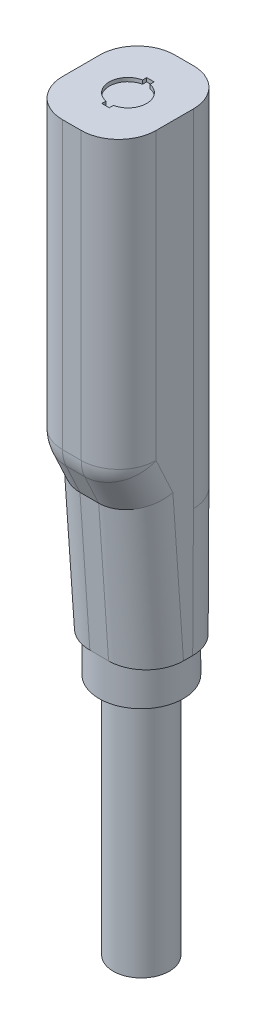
ISO-10303-21;
HEADER;
FILE_DESCRIPTION(('STEP AP214'),'2;1');
FILE_NAME('part.step','',(''),(''),'','','');
FILE_SCHEMA(('AUTOMOTIVE_DESIGN { 1 0 10303 214 1 1 1 1 }'));
ENDSEC;
DATA;
#1=APPLICATION_CONTEXT('core data for automotive mechanical design processes');
#2=APPLICATION_PROTOCOL_DEFINITION('international standard','automotive_design',2000,#1);
#3=PRODUCT_CONTEXT('',#1,'mechanical');
#4=PRODUCT('Part','Part','',(#3));
#5=PRODUCT_RELATED_PRODUCT_CATEGORY('part','',(#4));
#6=PRODUCT_DEFINITION_FORMATION('','',#4);
#7=PRODUCT_DEFINITION_CONTEXT('part definition',#1,'design');
#8=PRODUCT_DEFINITION('design','',#6,#7);
#9=PRODUCT_DEFINITION_SHAPE('','',#8);
#10=(LENGTH_UNIT() NAMED_UNIT(*) SI_UNIT(.MILLI.,.METRE.));
#11=(NAMED_UNIT(*) PLANE_ANGLE_UNIT() SI_UNIT($,.RADIAN.));
#12=(NAMED_UNIT(*) SI_UNIT($,.STERADIAN.) SOLID_ANGLE_UNIT());
#13=UNCERTAINTY_MEASURE_WITH_UNIT(LENGTH_MEASURE(1.E-05),#10,'distance_accuracy_value','');
#14=(GEOMETRIC_REPRESENTATION_CONTEXT(3) GLOBAL_UNCERTAINTY_ASSIGNED_CONTEXT((#13)) GLOBAL_UNIT_ASSIGNED_CONTEXT((#10,
#11,#12)) REPRESENTATION_CONTEXT('',''));
#15=CARTESIAN_POINT('',(0.,0.,0.));
#16=DIRECTION('',(0.,0.,1.));
#17=DIRECTION('',(1.,0.,0.));
#18=AXIS2_PLACEMENT_3D('',#15,#16,#17);
#19=CARTESIAN_POINT('',(0.,130.,0.));
#20=DIRECTION('',(0.,-1.,0.));
#21=DIRECTION('',(0.,0.,-1.));
#22=AXIS2_PLACEMENT_3D('',#19,#20,#21);
#23=CYLINDRICAL_SURFACE('',#22,15.);
#24=CARTESIAN_POINT('',(0.,130.,0.));
#25=DIRECTION('',(0.,1.,0.));
#26=DIRECTION('',(0.,0.,1.));
#27=AXIS2_PLACEMENT_3D('',#24,#25,#26);
#28=CIRCLE('',#27,15.);
#29=CARTESIAN_POINT('',(0.,130.,15.));
#30=VERTEX_POINT('',#29);
#31=EDGE_CURVE('E581',#30,#30,#28,.T.);
#32=ORIENTED_EDGE('',*,*,#31,.F.);
#33=EDGE_LOOP('',(#32));
#34=FACE_BOUND('',#33,.T.);
#35=CARTESIAN_POINT('',(0.,0.,0.));
#36=DIRECTION('',(0.,1.,0.));
#37=DIRECTION('',(0.,0.,1.));
#38=AXIS2_PLACEMENT_3D('',#35,#36,#37);
#39=CIRCLE('',#38,15.);
#40=CARTESIAN_POINT('',(0.,0.,15.));
#41=VERTEX_POINT('',#40);
#42=EDGE_CURVE('E577',#41,#41,#39,.T.);
#43=ORIENTED_EDGE('',*,*,#42,.T.);
#44=EDGE_LOOP('',(#43));
#45=FACE_BOUND('',#44,.T.);
#46=ADVANCED_FACE('F43',(#34,#45),#23,.T.);
#47=CARTESIAN_POINT('',(0.,0.,0.));
#48=DIRECTION('',(0.,1.,0.));
#49=DIRECTION('',(0.,0.,1.));
#50=AXIS2_PLACEMENT_3D('',#47,#48,#49);
#51=PLANE('',#50);
#52=ORIENTED_EDGE('',*,*,#42,.F.);
#53=EDGE_LOOP('',(#52));
#54=FACE_BOUND('',#53,.T.);
#55=ADVANCED_FACE('F693',(#54),#51,.F.);
#56=CARTESIAN_POINT('',(0.,150.,0.));
#57=DIRECTION('',(0.,-1.,0.));
#58=DIRECTION('',(0.,0.,-1.));
#59=AXIS2_PLACEMENT_3D('',#56,#57,#58);
#60=CYLINDRICAL_SURFACE('',#59,22.5);
#61=CARTESIAN_POINT('',(0.,150.,0.));
#62=DIRECTION('',(0.,1.,0.));
#63=DIRECTION('',(0.,0.,1.));
#64=AXIS2_PLACEMENT_3D('',#61,#62,#63);
#65=CIRCLE('',#64,22.5);
#66=CARTESIAN_POINT('',(0.,150.,22.5));
#67=VERTEX_POINT('',#66);
#68=CARTESIAN_POINT('',(0.,150.,-22.5));
#69=VERTEX_POINT('',#68);
#70=EDGE_CURVE('E574',#67,#69,#65,.T.);
#71=ORIENTED_EDGE('',*,*,#70,.F.);
#72=EDGE_CURVE('E578',#69,#67,#65,.T.);
#73=ORIENTED_EDGE('',*,*,#72,.F.);
#74=EDGE_LOOP('',(#71,#73));
#75=FACE_BOUND('',#74,.T.);
#76=CARTESIAN_POINT('',(0.,130.,0.));
#77=DIRECTION('',(0.,1.,0.));
#78=DIRECTION('',(0.,0.,1.));
#79=AXIS2_PLACEMENT_3D('',#76,#77,#78);
#80=CIRCLE('',#79,22.5);
#81=CARTESIAN_POINT('',(0.,130.,22.5));
#82=VERTEX_POINT('',#81);
#83=EDGE_CURVE('E566',#82,#82,#80,.T.);
#84=ORIENTED_EDGE('',*,*,#83,.T.);
#85=EDGE_LOOP('',(#84));
#86=FACE_BOUND('',#85,.T.);
#87=ADVANCED_FACE('F699',(#75,#86),#60,.T.);
#88=CARTESIAN_POINT('',(0.,130.,0.));
#89=DIRECTION('',(0.,1.,0.));
#90=DIRECTION('',(0.,0.,1.));
#91=AXIS2_PLACEMENT_3D('',#88,#89,#90);
#92=PLANE('',#91);
#93=ORIENTED_EDGE('',*,*,#31,.T.);
#94=EDGE_LOOP('',(#93));
#95=FACE_BOUND('',#94,.T.);
#96=ORIENTED_EDGE('',*,*,#83,.F.);
#97=EDGE_LOOP('',(#96));
#98=FACE_BOUND('',#97,.T.);
#99=ADVANCED_FACE('F1044',(#95,#98),#92,.F.);
#100=CARTESIAN_POINT('',(-25.,150.,22.5));
#101=DIRECTION('',(0.,-1.,0.));
#102=DIRECTION('',(0.,0.,-1.));
#103=AXIS2_PLACEMENT_3D('',#100,#101,#102);
#104=PLANE('',#103);
#105=DIRECTION('',(0.,0.,-1.));
#106=VECTOR('',#105,1.);
#107=CARTESIAN_POINT('',(25.,150.,22.5));
#108=LINE('',#107,#106);
#109=CARTESIAN_POINT('',(25.,150.,2.45116203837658));
#110=VERTEX_POINT('',#109);
#111=CARTESIAN_POINT('',(25.,150.,-2.49968403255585));
#112=VERTEX_POINT('',#111);
#113=EDGE_CURVE('E555',#110,#112,#108,.T.);
#114=ORIENTED_EDGE('',*,*,#113,.F.);
#115=CARTESIAN_POINT('',(5.,150.,2.45116203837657));
#116=DIRECTION('',(0.,-1.,0.));
#117=DIRECTION('',(0.,0.,-1.));
#118=AXIS2_PLACEMENT_3D('',#115,#116,#117);
#119=ELLIPSE('',#118,20.0488379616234,20.);
#120=CARTESIAN_POINT('',(5.,150.,22.5));
#121=VERTEX_POINT('',#120);
#122=EDGE_CURVE('E612',#110,#121,#119,.T.);
#123=ORIENTED_EDGE('',*,*,#122,.T.);
#124=DIRECTION('',(1.,0.,0.));
#125=VECTOR('',#124,1.);
#126=CARTESIAN_POINT('',(-25.,150.,22.5));
#127=LINE('',#126,#125);
#128=EDGE_CURVE('E562',#67,#121,#127,.T.);
#129=ORIENTED_EDGE('',*,*,#128,.F.);
#130=ORIENTED_EDGE('',*,*,#70,.T.);
#131=DIRECTION('',(1.,0.,0.));
#132=VECTOR('',#131,1.);
#133=CARTESIAN_POINT('',(-25.,150.,-22.5));
#134=LINE('',#133,#132);
#135=CARTESIAN_POINT('',(5.,150.,-22.5));
#136=VERTEX_POINT('',#135);
#137=EDGE_CURVE('E571',#69,#136,#134,.T.);
#138=ORIENTED_EDGE('',*,*,#137,.T.);
#139=CARTESIAN_POINT('',(5.,150.,-2.49968403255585));
#140=DIRECTION('',(0.,-1.,0.));
#141=DIRECTION('',(0.,0.,-1.));
#142=AXIS2_PLACEMENT_3D('',#139,#140,#141);
#143=ELLIPSE('',#142,20.0003159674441,20.);
#144=EDGE_CURVE('E610',#136,#112,#143,.T.);
#145=ORIENTED_EDGE('',*,*,#144,.T.);
#146=EDGE_LOOP('',(#114,#123,#129,#130,#138,#145));
#147=FACE_BOUND('',#146,.T.);
#148=ADVANCED_FACE('F996',(#147),#104,.T.);
#149=CARTESIAN_POINT('',(-25.,225.722395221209,27.7950256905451));
#150=DIRECTION('',(0.,-0.0697564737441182,0.997564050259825));
#151=DIRECTION('',(0.,-0.997564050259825,-0.0697564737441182));
#152=AXIS2_PLACEMENT_3D('',#149,#150,#151);
#153=PLANE('',#152);
#154=ORIENTED_EDGE('',*,*,#128,.T.);
#155=DIRECTION('',(0.,-0.997564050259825,-0.0697564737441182));
#156=VECTOR('',#155,1.);
#157=CARTESIAN_POINT('',(5.,225.722395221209,27.7950256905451));
#158=LINE('',#157,#156);
#159=CARTESIAN_POINT('',(5.,225.722395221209,27.7950256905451));
#160=VERTEX_POINT('',#159);
#161=EDGE_CURVE('E616',#121,#160,#158,.F.);
#162=ORIENTED_EDGE('',*,*,#161,.T.);
#163=DIRECTION('',(1.,0.,0.));
#164=VECTOR('',#163,1.);
#165=CARTESIAN_POINT('',(-25.,225.722395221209,27.7950256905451));
#166=LINE('',#165,#164);
#167=CARTESIAN_POINT('',(-5.,225.722395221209,27.7950256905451));
#168=VERTEX_POINT('',#167);
#169=EDGE_CURVE('E563',#168,#160,#166,.T.);
#170=ORIENTED_EDGE('',*,*,#169,.F.);
#171=DIRECTION('',(0.,-0.997564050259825,-0.0697564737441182));
#172=VECTOR('',#171,1.);
#173=CARTESIAN_POINT('',(-5.,150.,22.5));
#174=LINE('',#173,#172);
#175=CARTESIAN_POINT('',(-5.,150.,22.5));
#176=VERTEX_POINT('',#175);
#177=EDGE_CURVE('E614',#168,#176,#174,.T.);
#178=ORIENTED_EDGE('',*,*,#177,.T.);
#179=EDGE_CURVE('E572',#176,#67,#127,.T.);
#180=ORIENTED_EDGE('',*,*,#179,.T.);
#181=EDGE_LOOP('',(#154,#162,#170,#178,#180));
#182=FACE_BOUND('',#181,.T.);
#183=ADVANCED_FACE('F991',(#182),#153,.T.);
#184=CARTESIAN_POINT('',(-25.,245.717491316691,37.1188921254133));
#185=DIRECTION('',(0.,-0.422618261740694,0.906307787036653));
#186=DIRECTION('',(0.,-0.906307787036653,-0.422618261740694));
#187=AXIS2_PLACEMENT_3D('',#184,#185,#186);
#188=PLANE('',#187);
#189=ORIENTED_EDGE('',*,*,#169,.T.);
#190=DIRECTION('',(0.,-0.906307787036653,-0.422618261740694));
#191=VECTOR('',#190,1.);
#192=CARTESIAN_POINT('',(5.,245.717491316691,37.1188921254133));
#193=LINE('',#192,#191);
#194=CARTESIAN_POINT('',(5.,241.699019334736,35.2450478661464));
#195=VERTEX_POINT('',#194);
#196=EDGE_CURVE('E597',#160,#195,#193,.F.);
#197=ORIENTED_EDGE('',*,*,#196,.T.);
#198=DIRECTION('',(1.,0.,0.));
#199=VECTOR('',#198,1.);
#200=CARTESIAN_POINT('',(-25.,241.699019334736,35.2450478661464));
#201=LINE('',#200,#199);
#202=CARTESIAN_POINT('',(-5.,241.699019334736,35.2450478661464));
#203=VERTEX_POINT('',#202);
#204=EDGE_CURVE('E595',#195,#203,#201,.F.);
#205=ORIENTED_EDGE('',*,*,#204,.T.);
#206=DIRECTION('',(0.,-0.906307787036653,-0.422618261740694));
#207=VECTOR('',#206,1.);
#208=CARTESIAN_POINT('',(-5.,225.722395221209,27.7950256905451));
#209=LINE('',#208,#207);
#210=EDGE_CURVE('E593',#203,#168,#209,.T.);
#211=ORIENTED_EDGE('',*,*,#210,.T.);
#212=EDGE_LOOP('',(#189,#197,#205,#211));
#213=FACE_BOUND('',#212,.T.);
#214=ADVANCED_FACE('F689',(#213),#188,.T.);
#215=CARTESIAN_POINT('',(-25.,400.,37.1188921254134));
#216=DIRECTION('',(0.,0.,1.));
#217=DIRECTION('',(0.,-1.,0.));
#218=AXIS2_PLACEMENT_3D('',#215,#216,#217);
#219=PLANE('',#218);
#220=DIRECTION('',(1.,0.,0.));
#221=VECTOR('',#220,1.);
#222=CARTESIAN_POINT('',(-25.,250.151384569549,37.1188921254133));
#223=LINE('',#222,#221);
#224=CARTESIAN_POINT('',(-5.,250.151384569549,37.1188921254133));
#225=VERTEX_POINT('',#224);
#226=CARTESIAN_POINT('',(5.,250.151384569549,37.1188921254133));
#227=VERTEX_POINT('',#226);
#228=EDGE_CURVE('E588',#225,#227,#223,.T.);
#229=ORIENTED_EDGE('',*,*,#228,.T.);
#230=DIRECTION('',(0.,-1.,0.));
#231=VECTOR('',#230,1.);
#232=CARTESIAN_POINT('',(5.,400.,37.1188921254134));
#233=LINE('',#232,#231);
#234=CARTESIAN_POINT('',(5.,403.,37.1188921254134));
#235=VERTEX_POINT('',#234);
#236=EDGE_CURVE('E591',#227,#235,#233,.F.);
#237=ORIENTED_EDGE('',*,*,#236,.T.);
#238=DIRECTION('',(1.,0.,0.));
#239=VECTOR('',#238,1.);
#240=CARTESIAN_POINT('',(-5.,403.,37.1188921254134));
#241=LINE('',#240,#239);
#242=CARTESIAN_POINT('',(-5.,403.,37.1188921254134));
#243=VERTEX_POINT('',#242);
#244=EDGE_CURVE('E378',#243,#235,#241,.T.);
#245=ORIENTED_EDGE('',*,*,#244,.F.);
#246=DIRECTION('',(0.,-1.,0.));
#247=VECTOR('',#246,1.);
#248=CARTESIAN_POINT('',(-5.,245.717491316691,37.1188921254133));
#249=LINE('',#248,#247);
#250=EDGE_CURVE('E584',#243,#225,#249,.T.);
#251=ORIENTED_EDGE('',*,*,#250,.T.);
#252=EDGE_LOOP('',(#229,#237,#245,#251));
#253=FACE_BOUND('',#252,.T.);
#254=ADVANCED_FACE('F680',(#253),#219,.T.);
#255=CARTESIAN_POINT('',(-25.,217.799273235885,-22.8811078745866));
#256=DIRECTION('',(0.,0.,-1.));
#257=DIRECTION('',(-1.,0.,0.));
#258=AXIS2_PLACEMENT_3D('',#255,#256,#257);
#259=PLANE('',#258);
#260=DIRECTION('',(1.,0.,0.));
#261=VECTOR('',#260,1.);
#262=CARTESIAN_POINT('',(-25.,217.799273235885,-22.8811078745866));
#263=LINE('',#262,#261);
#264=CARTESIAN_POINT('',(-5.,217.799273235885,-22.8811078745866));
#265=VERTEX_POINT('',#264);
#266=CARTESIAN_POINT('',(5.,217.799273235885,-22.8811078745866));
#267=VERTEX_POINT('',#266);
#268=EDGE_CURVE('E567',#265,#267,#263,.T.);
#269=ORIENTED_EDGE('',*,*,#268,.F.);
#270=DIRECTION('',(0.,1.,0.));
#271=VECTOR('',#270,1.);
#272=CARTESIAN_POINT('',(-5.,400.,-22.8811078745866));
#273=LINE('',#272,#271);
#274=CARTESIAN_POINT('',(-5.,403.,-22.8811078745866));
#275=VERTEX_POINT('',#274);
#276=EDGE_CURVE('E11',#265,#275,#273,.T.);
#277=ORIENTED_EDGE('',*,*,#276,.T.);
#278=DIRECTION('',(-1.,0.,0.));
#279=VECTOR('',#278,1.);
#280=CARTESIAN_POINT('',(-5.,403.,-22.8811078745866));
#281=LINE('',#280,#279);
#282=CARTESIAN_POINT('',(5.,403.,-22.8811078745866));
#283=VERTEX_POINT('',#282);
#284=EDGE_CURVE('E390',#283,#275,#281,.T.);
#285=ORIENTED_EDGE('',*,*,#284,.F.);
#286=DIRECTION('',(0.,1.,0.));
#287=VECTOR('',#286,1.);
#288=CARTESIAN_POINT('',(5.,217.799273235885,-22.8811078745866));
#289=LINE('',#288,#287);
#290=EDGE_CURVE('E53',#283,#267,#289,.F.);
#291=ORIENTED_EDGE('',*,*,#290,.T.);
#292=EDGE_LOOP('',(#269,#277,#285,#291));
#293=FACE_BOUND('',#292,.T.);
#294=ADVANCED_FACE('F678',(#293),#259,.T.);
#295=CARTESIAN_POINT('',(-25.,150.,-22.5));
#296=DIRECTION('',(0.,-0.00562103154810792,-0.999984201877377));
#297=DIRECTION('',(0.,0.999984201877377,-0.00562103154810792));
#298=AXIS2_PLACEMENT_3D('',#295,#296,#297);
#299=PLANE('',#298);
#300=ORIENTED_EDGE('',*,*,#268,.T.);
#301=DIRECTION('',(0.,0.999984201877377,-0.00562103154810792));
#302=VECTOR('',#301,1.);
#303=CARTESIAN_POINT('',(5.,150.,-22.5));
#304=LINE('',#303,#302);
#305=EDGE_CURVE('E635',#267,#136,#304,.F.);
#306=ORIENTED_EDGE('',*,*,#305,.T.);
#307=ORIENTED_EDGE('',*,*,#137,.F.);
#308=CARTESIAN_POINT('',(-5.,150.,-22.5));
#309=VERTEX_POINT('',#308);
#310=EDGE_CURVE('E569',#309,#69,#134,.T.);
#311=ORIENTED_EDGE('',*,*,#310,.F.);
#312=DIRECTION('',(0.,0.999984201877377,-0.00562103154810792));
#313=VECTOR('',#312,1.);
#314=CARTESIAN_POINT('',(-5.,217.799273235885,-22.8811078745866));
#315=LINE('',#314,#313);
#316=EDGE_CURVE('E632',#309,#265,#315,.T.);
#317=ORIENTED_EDGE('',*,*,#316,.T.);
#318=EDGE_LOOP('',(#300,#306,#307,#311,#317));
#319=FACE_BOUND('',#318,.T.);
#320=ADVANCED_FACE('F676',(#319),#299,.T.);
#321=ORIENTED_EDGE('',*,*,#179,.F.);
#322=CARTESIAN_POINT('',(-5.,150.,2.45116203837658));
#323=DIRECTION('',(0.,-1.,0.));
#324=DIRECTION('',(0.,0.,1.));
#325=AXIS2_PLACEMENT_3D('',#322,#323,#324);
#326=ELLIPSE('',#325,20.0488379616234,20.);
#327=CARTESIAN_POINT('',(-25.,150.,2.45116203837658));
#328=VERTEX_POINT('',#327);
#329=EDGE_CURVE('E630',#176,#328,#326,.T.);
#330=ORIENTED_EDGE('',*,*,#329,.T.);
#331=DIRECTION('',(0.,0.,-1.));
#332=VECTOR('',#331,1.);
#333=CARTESIAN_POINT('',(-25.,150.,22.5));
#334=LINE('',#333,#332);
#335=CARTESIAN_POINT('',(-25.,150.,-2.49968403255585));
#336=VERTEX_POINT('',#335);
#337=EDGE_CURVE('E558',#328,#336,#334,.T.);
#338=ORIENTED_EDGE('',*,*,#337,.T.);
#339=CARTESIAN_POINT('',(-5.,150.,-2.49968403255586));
#340=DIRECTION('',(0.,-1.,0.));
#341=DIRECTION('',(0.,0.,1.));
#342=AXIS2_PLACEMENT_3D('',#339,#340,#341);
#343=ELLIPSE('',#342,20.0003159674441,20.);
#344=EDGE_CURVE('E628',#336,#309,#343,.T.);
#345=ORIENTED_EDGE('',*,*,#344,.T.);
#346=ORIENTED_EDGE('',*,*,#310,.T.);
#347=ORIENTED_EDGE('',*,*,#72,.T.);
#348=EDGE_LOOP('',(#321,#330,#338,#345,#346,#347));
#349=FACE_BOUND('',#348,.T.);
#350=ADVANCED_FACE('F687',(#349),#104,.T.);
#351=CARTESIAN_POINT('',(-25.,0.,0.));
#352=DIRECTION('',(1.,0.,0.));
#353=DIRECTION('',(0.,0.,-1.));
#354=AXIS2_PLACEMENT_3D('',#351,#352,#353);
#355=PLANE('',#354);
#356=DIRECTION('',(0.,-0.906307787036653,-0.422618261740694));
#357=VECTOR('',#356,1.);
#358=CARTESIAN_POINT('',(-25.,254.169856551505,18.9927363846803));
#359=LINE('',#358,#357);
#360=CARTESIAN_POINT('',(-25.,230.815276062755,8.10231664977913));
#361=VERTEX_POINT('',#360);
#362=CARTESIAN_POINT('',(-25.,250.151384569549,17.1188921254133));
#363=VERTEX_POINT('',#362);
#364=EDGE_CURVE('E624',#361,#363,#359,.F.);
#365=ORIENTED_EDGE('',*,*,#364,.T.);
#366=DIRECTION('',(0.,-1.,0.));
#367=VECTOR('',#366,1.);
#368=CARTESIAN_POINT('',(-25.,400.,17.1188921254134));
#369=LINE('',#368,#367);
#370=CARTESIAN_POINT('',(-25.,403.,17.1188921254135));
#371=VERTEX_POINT('',#370);
#372=EDGE_CURVE('E626',#363,#371,#369,.F.);
#373=ORIENTED_EDGE('',*,*,#372,.T.);
#374=DIRECTION('',(0.,0.,1.));
#375=VECTOR('',#374,1.);
#376=CARTESIAN_POINT('',(-25.,403.,-2.88110787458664));
#377=LINE('',#376,#375);
#378=CARTESIAN_POINT('',(-25.,403.,-2.88110787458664));
#379=VERTEX_POINT('',#378);
#380=EDGE_CURVE('E372',#379,#371,#377,.T.);
#381=ORIENTED_EDGE('',*,*,#380,.F.);
#382=DIRECTION('',(0.,1.,0.));
#383=VECTOR('',#382,1.);
#384=CARTESIAN_POINT('',(-25.,217.799273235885,-2.88110787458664));
#385=LINE('',#384,#383);
#386=CARTESIAN_POINT('',(-25.,217.855483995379,-2.88110787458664));
#387=VERTEX_POINT('',#386);
#388=EDGE_CURVE('E618',#379,#387,#385,.F.);
#389=ORIENTED_EDGE('',*,*,#388,.T.);
#390=DIRECTION('',(0.,0.999984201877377,-0.00562103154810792));
#391=VECTOR('',#390,1.);
#392=CARTESIAN_POINT('',(-25.,150.112420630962,-2.50031596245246));
#393=LINE('',#392,#391);
#394=EDGE_CURVE('E620',#387,#336,#393,.F.);
#395=ORIENTED_EDGE('',*,*,#394,.T.);
#396=ORIENTED_EDGE('',*,*,#337,.F.);
#397=DIRECTION('',(0.,-0.997564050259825,-0.0697564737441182));
#398=VECTOR('',#397,1.);
#399=CARTESIAN_POINT('',(-25.,227.117524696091,7.8437446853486));
#400=LINE('',#399,#398);
#401=EDGE_CURVE('E622',#328,#361,#400,.F.);
#402=ORIENTED_EDGE('',*,*,#401,.T.);
#403=EDGE_LOOP('',(#365,#373,#381,#389,#395,#396,#402));
#404=FACE_BOUND('',#403,.T.);
#405=ADVANCED_FACE('F986',(#404),#355,.F.);
#406=CARTESIAN_POINT('',(25.,0.,0.));
#407=DIRECTION('',(1.,0.,0.));
#408=DIRECTION('',(0.,0.,-1.));
#409=AXIS2_PLACEMENT_3D('',#406,#407,#408);
#410=PLANE('',#409);
#411=DIRECTION('',(0.,1.,0.));
#412=VECTOR('',#411,1.);
#413=CARTESIAN_POINT('',(25.,0.,-2.88110787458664));
#414=LINE('',#413,#412);
#415=CARTESIAN_POINT('',(25.,217.855483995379,-2.88110787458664));
#416=VERTEX_POINT('',#415);
#417=CARTESIAN_POINT('',(25.,403.,-2.88110787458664));
#418=VERTEX_POINT('',#417);
#419=EDGE_CURVE('E599',#416,#418,#414,.T.);
#420=ORIENTED_EDGE('',*,*,#419,.T.);
#421=DIRECTION('',(0.,0.,-1.));
#422=VECTOR('',#421,1.);
#423=CARTESIAN_POINT('',(25.,403.,-2.88110787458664));
#424=LINE('',#423,#422);
#425=CARTESIAN_POINT('',(25.,403.,17.1188921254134));
#426=VERTEX_POINT('',#425);
#427=EDGE_CURVE('E384',#426,#418,#424,.T.);
#428=ORIENTED_EDGE('',*,*,#427,.F.);
#429=DIRECTION('',(0.,-1.,0.));
#430=VECTOR('',#429,1.);
#431=CARTESIAN_POINT('',(25.,0.,17.1188921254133));
#432=LINE('',#431,#430);
#433=CARTESIAN_POINT('',(25.,250.151384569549,17.1188921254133));
#434=VERTEX_POINT('',#433);
#435=EDGE_CURVE('E608',#426,#434,#432,.T.);
#436=ORIENTED_EDGE('',*,*,#435,.T.);
#437=DIRECTION('',(0.,-0.906307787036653,-0.422618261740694));
#438=VECTOR('',#437,1.);
#439=CARTESIAN_POINT('',(25.,38.1216709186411,-81.7521871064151));
#440=LINE('',#439,#438);
#441=CARTESIAN_POINT('',(25.,230.815276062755,8.10231664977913));
#442=VERTEX_POINT('',#441);
#443=EDGE_CURVE('E606',#434,#442,#440,.T.);
#444=ORIENTED_EDGE('',*,*,#443,.T.);
#445=DIRECTION('',(0.,-0.997564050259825,-0.0697564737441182));
#446=VECTOR('',#445,1.);
#447=CARTESIAN_POINT('',(25.,0.559326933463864,-7.99874780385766));
#448=LINE('',#447,#446);
#449=EDGE_CURVE('E604',#442,#110,#448,.T.);
#450=ORIENTED_EDGE('',*,*,#449,.T.);
#451=ORIENTED_EDGE('',*,*,#113,.T.);
#452=DIRECTION('',(0.,0.999984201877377,-0.00562103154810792));
#453=VECTOR('',#452,1.);
#454=CARTESIAN_POINT('',(25.,-0.00931118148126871,-1.65646364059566));
#455=LINE('',#454,#453);
#456=EDGE_CURVE('E601',#112,#416,#455,.T.);
#457=ORIENTED_EDGE('',*,*,#456,.T.);
#458=EDGE_LOOP('',(#420,#428,#436,#444,#450,#451,#457));
#459=FACE_BOUND('',#458,.T.);
#460=ADVANCED_FACE('F742',(#459),#410,.T.);
#461=CARTESIAN_POINT('',(-5.,227.117524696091,7.8437446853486));
#462=DIRECTION('',(0.,0.997564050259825,0.0697564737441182));
#463=DIRECTION('',(0.,-0.0697564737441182,0.997564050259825));
#464=AXIS2_PLACEMENT_3D('',#461,#462,#463);
#465=CYLINDRICAL_SURFACE('',#464,20.);
#466=ORIENTED_EDGE('',*,*,#329,.F.);
#467=ORIENTED_EDGE('',*,*,#177,.F.);
#468=CARTESIAN_POINT('',(-5.,230.815276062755,8.10231664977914));
#469=DIRECTION('',(0.,0.968147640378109,0.250380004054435));
#470=DIRECTION('',(0.,-0.250380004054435,0.96814764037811));
#471=AXIS2_PLACEMENT_3D('',#468,#469,#470);
#472=ELLIPSE('',#471,20.3406053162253,20.);
#473=EDGE_CURVE('E559',#361,#168,#472,.T.);
#474=ORIENTED_EDGE('',*,*,#473,.F.);
#475=ORIENTED_EDGE('',*,*,#401,.F.);
#476=EDGE_LOOP('',(#466,#467,#474,#475));
#477=FACE_BOUND('',#476,.T.);
#478=ADVANCED_FACE('F738',(#477),#465,.T.);
#479=CARTESIAN_POINT('',(5.,0.559326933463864,-7.99874780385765));
#480=DIRECTION('',(0.,-0.997564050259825,-0.0697564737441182));
#481=DIRECTION('',(0.,0.0697564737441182,-0.997564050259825));
#482=AXIS2_PLACEMENT_3D('',#479,#480,#481);
#483=CYLINDRICAL_SURFACE('',#482,20.);
#484=ORIENTED_EDGE('',*,*,#122,.F.);
#485=ORIENTED_EDGE('',*,*,#449,.F.);
#486=CARTESIAN_POINT('',(5.,230.815276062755,8.10231664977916));
#487=DIRECTION('',(0.,-0.968147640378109,-0.250380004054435));
#488=DIRECTION('',(0.,0.250380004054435,-0.96814764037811));
#489=AXIS2_PLACEMENT_3D('',#486,#487,#488);
#490=ELLIPSE('',#489,20.3406053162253,20.);
#491=EDGE_CURVE('E656',#160,#442,#490,.F.);
#492=ORIENTED_EDGE('',*,*,#491,.F.);
#493=ORIENTED_EDGE('',*,*,#161,.F.);
#494=EDGE_LOOP('',(#484,#485,#492,#493));
#495=FACE_BOUND('',#494,.T.);
#496=ADVANCED_FACE('F734',(#495),#483,.T.);
#497=CARTESIAN_POINT('',(-5.,254.169856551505,18.9927363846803));
#498=DIRECTION('',(0.,0.906307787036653,0.422618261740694));
#499=DIRECTION('',(0.,-0.422618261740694,0.906307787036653));
#500=AXIS2_PLACEMENT_3D('',#497,#498,#499);
#501=CYLINDRICAL_SURFACE('',#500,20.);
#502=ORIENTED_EDGE('',*,*,#473,.T.);
#503=ORIENTED_EDGE('',*,*,#210,.F.);
#504=CARTESIAN_POINT('',(-5.,250.151384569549,17.1188921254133));
#505=DIRECTION('',(0.,0.906307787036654,0.422618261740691));
#506=DIRECTION('',(0.,-0.422618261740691,0.906307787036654));
#507=AXIS2_PLACEMENT_3D('',#504,#505,#506);
#508=CIRCLE('',#507,20.);
#509=EDGE_CURVE('E653',#363,#203,#508,.T.);
#510=ORIENTED_EDGE('',*,*,#509,.F.);
#511=ORIENTED_EDGE('',*,*,#364,.F.);
#512=EDGE_LOOP('',(#502,#503,#510,#511));
#513=FACE_BOUND('',#512,.T.);
#514=ADVANCED_FACE('F730',(#513),#501,.T.);
#515=CARTESIAN_POINT('',(-5.,400.,17.1188921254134));
#516=DIRECTION('',(0.,1.,0.));
#517=DIRECTION('',(0.,0.,1.));
#518=AXIS2_PLACEMENT_3D('',#515,#516,#517);
#519=CYLINDRICAL_SURFACE('',#518,20.);
#520=ORIENTED_EDGE('',*,*,#250,.F.);
#521=CARTESIAN_POINT('',(-5.00000000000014,403.,17.1188921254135));
#522=DIRECTION('',(0.,1.,0.));
#523=DIRECTION('',(0.,0.,1.));
#524=AXIS2_PLACEMENT_3D('',#521,#522,#523);
#525=CIRCLE('',#524,19.9999999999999);
#526=EDGE_CURVE('E375',#371,#243,#525,.T.);
#527=ORIENTED_EDGE('',*,*,#526,.F.);
#528=ORIENTED_EDGE('',*,*,#372,.F.);
#529=CARTESIAN_POINT('',(-5.,250.151384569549,17.1188921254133));
#530=DIRECTION('',(0.,-1.,0.));
#531=DIRECTION('',(1.,0.,0.));
#532=AXIS2_PLACEMENT_3D('',#529,#530,#531);
#533=CIRCLE('',#532,20.);
#534=EDGE_CURVE('E650',#225,#363,#533,.T.);
#535=ORIENTED_EDGE('',*,*,#534,.F.);
#536=EDGE_LOOP('',(#520,#527,#528,#535));
#537=FACE_BOUND('',#536,.T.);
#538=ADVANCED_FACE('F726',(#537),#519,.T.);
#539=CARTESIAN_POINT('',(5.,0.,17.1188921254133));
#540=DIRECTION('',(0.,-1.,0.));
#541=DIRECTION('',(0.,0.,-1.));
#542=AXIS2_PLACEMENT_3D('',#539,#540,#541);
#543=CYLINDRICAL_SURFACE('',#542,20.);
#544=ORIENTED_EDGE('',*,*,#435,.F.);
#545=CARTESIAN_POINT('',(5.,403.,17.1188921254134));
#546=DIRECTION('',(0.,1.,0.));
#547=DIRECTION('',(0.,0.,1.));
#548=AXIS2_PLACEMENT_3D('',#545,#546,#547);
#549=CIRCLE('',#548,20.);
#550=EDGE_CURVE('E381',#235,#426,#549,.T.);
#551=ORIENTED_EDGE('',*,*,#550,.F.);
#552=ORIENTED_EDGE('',*,*,#236,.F.);
#553=CARTESIAN_POINT('',(5.,250.151384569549,17.1188921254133));
#554=DIRECTION('',(0.,-1.,0.));
#555=DIRECTION('',(0.,0.,-1.));
#556=AXIS2_PLACEMENT_3D('',#553,#554,#555);
#557=CIRCLE('',#556,20.);
#558=EDGE_CURVE('E647',#434,#227,#557,.T.);
#559=ORIENTED_EDGE('',*,*,#558,.F.);
#560=EDGE_LOOP('',(#544,#551,#552,#559));
#561=FACE_BOUND('',#560,.T.);
#562=ADVANCED_FACE('F722',(#561),#543,.T.);
#563=CARTESIAN_POINT('',(5.,38.1216709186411,-81.7521871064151));
#564=DIRECTION('',(0.,-0.906307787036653,-0.422618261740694));
#565=DIRECTION('',(0.,0.422618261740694,-0.906307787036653));
#566=AXIS2_PLACEMENT_3D('',#563,#564,#565);
#567=CYLINDRICAL_SURFACE('',#566,20.);
#568=ORIENTED_EDGE('',*,*,#491,.T.);
#569=ORIENTED_EDGE('',*,*,#443,.F.);
#570=CARTESIAN_POINT('',(5.,250.151384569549,17.1188921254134));
#571=DIRECTION('',(0.,0.906307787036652,0.422618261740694));
#572=DIRECTION('',(0.,-0.422618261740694,0.906307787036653));
#573=AXIS2_PLACEMENT_3D('',#570,#571,#572);
#574=CIRCLE('',#573,20.);
#575=EDGE_CURVE('E644',#195,#434,#574,.T.);
#576=ORIENTED_EDGE('',*,*,#575,.F.);
#577=ORIENTED_EDGE('',*,*,#196,.F.);
#578=EDGE_LOOP('',(#568,#569,#576,#577));
#579=FACE_BOUND('',#578,.T.);
#580=ADVANCED_FACE('F718',(#579),#567,.T.);
#581=CARTESIAN_POINT('',(-5.,250.151384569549,17.1188921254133));
#582=DIRECTION('',(0.,0.,1.));
#583=DIRECTION('',(1.,0.,0.));
#584=AXIS2_PLACEMENT_3D('',#581,#582,#583);
#585=SPHERICAL_SURFACE('',#584,20.);
#586=ORIENTED_EDGE('',*,*,#534,.T.);
#587=ORIENTED_EDGE('',*,*,#509,.T.);
#588=CARTESIAN_POINT('',(-5.,250.151384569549,17.1188921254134));
#589=DIRECTION('',(-1.,0.,0.));
#590=DIRECTION('',(0.,0.,1.));
#591=AXIS2_PLACEMENT_3D('',#588,#589,#590);
#592=CIRCLE('',#591,20.);
#593=EDGE_CURVE('E640',#225,#203,#592,.F.);
#594=ORIENTED_EDGE('',*,*,#593,.F.);
#595=EDGE_LOOP('',(#586,#587,#594));
#596=FACE_BOUND('',#595,.T.);
#597=ADVANCED_FACE('F714',(#596),#585,.T.);
#598=CARTESIAN_POINT('',(5.,250.151384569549,17.1188921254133));
#599=DIRECTION('',(0.,0.,1.));
#600=DIRECTION('',(1.,0.,0.));
#601=AXIS2_PLACEMENT_3D('',#598,#599,#600);
#602=SPHERICAL_SURFACE('',#601,20.);
#603=ORIENTED_EDGE('',*,*,#575,.T.);
#604=ORIENTED_EDGE('',*,*,#558,.T.);
#605=CARTESIAN_POINT('',(5.,250.151384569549,17.1188921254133));
#606=DIRECTION('',(1.,0.,0.));
#607=DIRECTION('',(0.,0.,-1.));
#608=AXIS2_PLACEMENT_3D('',#605,#606,#607);
#609=CIRCLE('',#608,20.);
#610=EDGE_CURVE('E638',#195,#227,#609,.F.);
#611=ORIENTED_EDGE('',*,*,#610,.F.);
#612=EDGE_LOOP('',(#603,#604,#611));
#613=FACE_BOUND('',#612,.T.);
#614=ADVANCED_FACE('F710',(#613),#602,.T.);
#615=CARTESIAN_POINT('',(-25.,250.151384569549,17.1188921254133));
#616=DIRECTION('',(1.,0.,0.));
#617=DIRECTION('',(0.,0.,-1.));
#618=AXIS2_PLACEMENT_3D('',#615,#616,#617);
#619=CYLINDRICAL_SURFACE('',#618,20.);
#620=ORIENTED_EDGE('',*,*,#593,.T.);
#621=ORIENTED_EDGE('',*,*,#204,.F.);
#622=ORIENTED_EDGE('',*,*,#610,.T.);
#623=ORIENTED_EDGE('',*,*,#228,.F.);
#624=EDGE_LOOP('',(#620,#621,#622,#623));
#625=FACE_BOUND('',#624,.T.);
#626=ADVANCED_FACE('F706',(#625),#619,.T.);
#627=CARTESIAN_POINT('',(5.,0.,-2.88110787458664));
#628=DIRECTION('',(0.,1.,0.));
#629=DIRECTION('',(0.,0.,1.));
#630=AXIS2_PLACEMENT_3D('',#627,#628,#629);
#631=CYLINDRICAL_SURFACE('',#630,20.);
#632=ORIENTED_EDGE('',*,*,#290,.F.);
#633=CARTESIAN_POINT('',(5.,403.,-2.88110787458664));
#634=DIRECTION('',(0.,1.,0.));
#635=DIRECTION('',(0.,0.,-1.));
#636=AXIS2_PLACEMENT_3D('',#633,#634,#635);
#637=CIRCLE('',#636,20.);
#638=EDGE_CURVE('E387',#418,#283,#637,.T.);
#639=ORIENTED_EDGE('',*,*,#638,.F.);
#640=ORIENTED_EDGE('',*,*,#419,.F.);
#641=CARTESIAN_POINT('',(5.,217.855483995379,-2.88110787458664));
#642=DIRECTION('',(0.,0.999996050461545,-0.00281052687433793));
#643=DIRECTION('',(0.,0.00281052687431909,0.999996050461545));
#644=AXIS2_PLACEMENT_3D('',#641,#642,#643);
#645=ELLIPSE('',#644,20.0000789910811,20.);
#646=EDGE_CURVE('E641',#267,#416,#645,.F.);
#647=ORIENTED_EDGE('',*,*,#646,.F.);
#648=EDGE_LOOP('',(#632,#639,#640,#647));
#649=FACE_BOUND('',#648,.T.);
#650=ADVANCED_FACE('F709',(#649),#631,.T.);
#651=CARTESIAN_POINT('',(5.,-0.00931118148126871,-1.65646364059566));
#652=DIRECTION('',(0.,0.999984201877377,-0.00562103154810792));
#653=DIRECTION('',(0.,0.00562103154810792,0.999984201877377));
#654=AXIS2_PLACEMENT_3D('',#651,#652,#653);
#655=CYLINDRICAL_SURFACE('',#654,20.);
#656=ORIENTED_EDGE('',*,*,#144,.F.);
#657=ORIENTED_EDGE('',*,*,#305,.F.);
#658=ORIENTED_EDGE('',*,*,#646,.T.);
#659=ORIENTED_EDGE('',*,*,#456,.F.);
#660=EDGE_LOOP('',(#656,#657,#658,#659));
#661=FACE_BOUND('',#660,.T.);
#662=ADVANCED_FACE('F744',(#661),#655,.T.);
#663=CARTESIAN_POINT('',(-5.,217.799273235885,-2.88110787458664));
#664=DIRECTION('',(0.,-1.,0.));
#665=DIRECTION('',(0.,0.,-1.));
#666=AXIS2_PLACEMENT_3D('',#663,#664,#665);
#667=CYLINDRICAL_SURFACE('',#666,20.);
#668=ORIENTED_EDGE('',*,*,#388,.F.);
#669=CARTESIAN_POINT('',(-5.,403.,-2.88110787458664));
#670=DIRECTION('',(0.,1.,0.));
#671=DIRECTION('',(0.,0.,1.));
#672=AXIS2_PLACEMENT_3D('',#669,#670,#671);
#673=CIRCLE('',#672,20.);
#674=EDGE_CURVE('E358',#275,#379,#673,.T.);
#675=ORIENTED_EDGE('',*,*,#674,.F.);
#676=ORIENTED_EDGE('',*,*,#276,.F.);
#677=CARTESIAN_POINT('',(-5.,217.855483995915,-2.88110787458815));
#678=DIRECTION('',(0.,-0.999996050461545,0.00281052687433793));
#679=DIRECTION('',(0.,-0.00281052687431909,-0.999996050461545));
#680=AXIS2_PLACEMENT_3D('',#677,#678,#679);
#681=ELLIPSE('',#680,20.0000789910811,20.);
#682=EDGE_CURVE('E47',#387,#265,#681,.T.);
#683=ORIENTED_EDGE('',*,*,#682,.F.);
#684=EDGE_LOOP('',(#668,#675,#676,#683));
#685=FACE_BOUND('',#684,.T.);
#686=ADVANCED_FACE('F45',(#685),#667,.T.);
#687=CARTESIAN_POINT('',(-5.,150.112420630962,-2.50031596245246));
#688=DIRECTION('',(0.,-0.999984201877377,0.00562103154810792));
#689=DIRECTION('',(0.,-0.00562103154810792,-0.999984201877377));
#690=AXIS2_PLACEMENT_3D('',#687,#688,#689);
#691=CYLINDRICAL_SURFACE('',#690,20.);
#692=ORIENTED_EDGE('',*,*,#344,.F.);
#693=ORIENTED_EDGE('',*,*,#394,.F.);
#694=ORIENTED_EDGE('',*,*,#682,.T.);
#695=ORIENTED_EDGE('',*,*,#316,.F.);
#696=EDGE_LOOP('',(#692,#693,#694,#695));
#697=FACE_BOUND('',#696,.T.);
#698=ADVANCED_FACE('F671',(#697),#691,.T.);
#699=CARTESIAN_POINT('',(-5.,403.,-2.88110787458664));
#700=DIRECTION('',(0.,1.,0.));
#701=DIRECTION('',(0.,0.,1.));
#702=AXIS2_PLACEMENT_3D('',#699,#700,#701);
#703=PLANE('',#702);
#704=CARTESIAN_POINT('',(0.,403.,7.11889212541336));
#705=DIRECTION('',(0.,1.,0.));
#706=DIRECTION('',(0.,0.,1.));
#707=AXIS2_PLACEMENT_3D('',#704,#705,#706);
#708=CIRCLE('',#707,10.);
#709=CARTESIAN_POINT('',(-2.,403.,-2.67906684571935));
#710=VERTEX_POINT('',#709);
#711=CARTESIAN_POINT('',(-2.,403.,16.9168510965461));
#712=VERTEX_POINT('',#711);
#713=EDGE_CURVE('E61',#710,#712,#708,.T.);
#714=ORIENTED_EDGE('',*,*,#713,.F.);
#715=DIRECTION('',(0.,0.,1.));
#716=VECTOR('',#715,1.);
#717=CARTESIAN_POINT('',(-2.,403.,-2.67906684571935));
#718=LINE('',#717,#716);
#719=CARTESIAN_POINT('',(-2.,403.,-4.88110787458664));
#720=VERTEX_POINT('',#719);
#721=EDGE_CURVE('E320',#720,#710,#718,.T.);
#722=ORIENTED_EDGE('',*,*,#721,.F.);
#723=DIRECTION('',(-1.,0.,0.));
#724=VECTOR('',#723,1.);
#725=CARTESIAN_POINT('',(-2.,403.,-4.88110787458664));
#726=LINE('',#725,#724);
#727=CARTESIAN_POINT('',(2.,403.,-4.88110787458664));
#728=VERTEX_POINT('',#727);
#729=EDGE_CURVE('E323',#728,#720,#726,.T.);
#730=ORIENTED_EDGE('',*,*,#729,.F.);
#731=DIRECTION('',(0.,0.,-1.));
#732=VECTOR('',#731,1.);
#733=CARTESIAN_POINT('',(2.,403.,-2.67906684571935));
#734=LINE('',#733,#732);
#735=CARTESIAN_POINT('',(2.,403.,-2.67906684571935));
#736=VERTEX_POINT('',#735);
#737=EDGE_CURVE('E351',#736,#728,#734,.T.);
#738=ORIENTED_EDGE('',*,*,#737,.F.);
#739=CARTESIAN_POINT('',(0.,403.,7.11889212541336));
#740=DIRECTION('',(0.,1.,0.));
#741=DIRECTION('',(0.,0.,1.));
#742=AXIS2_PLACEMENT_3D('',#739,#740,#741);
#743=CIRCLE('',#742,10.);
#744=CARTESIAN_POINT('',(2.,403.,16.9168510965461));
#745=VERTEX_POINT('',#744);
#746=EDGE_CURVE('E348',#745,#736,#743,.T.);
#747=ORIENTED_EDGE('',*,*,#746,.F.);
#748=DIRECTION('',(0.,0.,-1.));
#749=VECTOR('',#748,1.);
#750=CARTESIAN_POINT('',(2.,403.,16.9168510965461));
#751=LINE('',#750,#749);
#752=CARTESIAN_POINT('',(2.,403.,19.1188921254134));
#753=VERTEX_POINT('',#752);
#754=EDGE_CURVE('E345',#753,#745,#751,.T.);
#755=ORIENTED_EDGE('',*,*,#754,.F.);
#756=DIRECTION('',(1.,0.,0.));
#757=VECTOR('',#756,1.);
#758=CARTESIAN_POINT('',(-2.,403.,19.1188921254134));
#759=LINE('',#758,#757);
#760=CARTESIAN_POINT('',(-2.,403.,19.1188921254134));
#761=VERTEX_POINT('',#760);
#762=EDGE_CURVE('E342',#761,#753,#759,.T.);
#763=ORIENTED_EDGE('',*,*,#762,.F.);
#764=DIRECTION('',(0.,0.,1.));
#765=VECTOR('',#764,1.);
#766=CARTESIAN_POINT('',(-2.,403.,16.9168510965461));
#767=LINE('',#766,#765);
#768=EDGE_CURVE('E340',#712,#761,#767,.T.);
#769=ORIENTED_EDGE('',*,*,#768,.F.);
#770=EDGE_LOOP('',(#714,#722,#730,#738,#747,#755,#763,#769));
#771=FACE_BOUND('',#770,.T.);
#772=ORIENTED_EDGE('',*,*,#674,.T.);
#773=ORIENTED_EDGE('',*,*,#380,.T.);
#774=ORIENTED_EDGE('',*,*,#526,.T.);
#775=ORIENTED_EDGE('',*,*,#244,.T.);
#776=ORIENTED_EDGE('',*,*,#550,.T.);
#777=ORIENTED_EDGE('',*,*,#427,.T.);
#778=ORIENTED_EDGE('',*,*,#638,.T.);
#779=ORIENTED_EDGE('',*,*,#284,.T.);
#780=EDGE_LOOP('',(#772,#773,#774,#775,#776,#777,#778,#779));
#781=FACE_BOUND('',#780,.T.);
#782=ADVANCED_FACE('F750',(#771,#781),#703,.T.);
#783=CARTESIAN_POINT('',(0.,401.,7.11889212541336));
#784=DIRECTION('',(0.,1.,0.));
#785=DIRECTION('',(0.,0.,1.));
#786=AXIS2_PLACEMENT_3D('',#783,#784,#785);
#787=CYLINDRICAL_SURFACE('',#786,10.);
#788=ORIENTED_EDGE('',*,*,#713,.T.);
#789=DIRECTION('',(0.,1.,0.));
#790=VECTOR('',#789,1.);
#791=CARTESIAN_POINT('',(-2.,401.,16.9168510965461));
#792=LINE('',#791,#790);
#793=CARTESIAN_POINT('',(-2.,401.,16.9168510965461));
#794=VERTEX_POINT('',#793);
#795=EDGE_CURVE('E297',#794,#712,#792,.T.);
#796=ORIENTED_EDGE('',*,*,#795,.F.);
#797=CARTESIAN_POINT('',(0.,401.,7.11889212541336));
#798=DIRECTION('',(0.,1.,0.));
#799=DIRECTION('',(0.,0.,1.));
#800=AXIS2_PLACEMENT_3D('',#797,#798,#799);
#801=CIRCLE('',#800,10.);
#802=CARTESIAN_POINT('',(-2.,401.,-2.67906684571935));
#803=VERTEX_POINT('',#802);
#804=EDGE_CURVE('E301',#803,#794,#801,.T.);
#805=ORIENTED_EDGE('',*,*,#804,.F.);
#806=DIRECTION('',(0.,1.,0.));
#807=VECTOR('',#806,1.);
#808=CARTESIAN_POINT('',(-2.,401.,-2.67906684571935));
#809=LINE('',#808,#807);
#810=EDGE_CURVE('E356',#803,#710,#809,.T.);
#811=ORIENTED_EDGE('',*,*,#810,.T.);
#812=EDGE_LOOP('',(#788,#796,#805,#811));
#813=FACE_BOUND('',#812,.T.);
#814=ADVANCED_FACE('F299',(#813),#787,.F.);
#815=CARTESIAN_POINT('',(-2.,401.,-2.67906684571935));
#816=DIRECTION('',(-1.,0.,0.));
#817=DIRECTION('',(0.,0.,1.));
#818=AXIS2_PLACEMENT_3D('',#815,#816,#817);
#819=PLANE('',#818);
#820=ORIENTED_EDGE('',*,*,#721,.T.);
#821=ORIENTED_EDGE('',*,*,#810,.F.);
#822=DIRECTION('',(0.,0.,1.));
#823=VECTOR('',#822,1.);
#824=CARTESIAN_POINT('',(-2.,401.,-2.67906684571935));
#825=LINE('',#824,#823);
#826=CARTESIAN_POINT('',(-2.,401.,-4.88110787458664));
#827=VERTEX_POINT('',#826);
#828=EDGE_CURVE('E307',#827,#803,#825,.T.);
#829=ORIENTED_EDGE('',*,*,#828,.F.);
#830=DIRECTION('',(0.,1.,0.));
#831=VECTOR('',#830,1.);
#832=CARTESIAN_POINT('',(-2.,401.,-4.88110787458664));
#833=LINE('',#832,#831);
#834=EDGE_CURVE('E359',#827,#720,#833,.T.);
#835=ORIENTED_EDGE('',*,*,#834,.T.);
#836=EDGE_LOOP('',(#820,#821,#829,#835));
#837=FACE_BOUND('',#836,.T.);
#838=ADVANCED_FACE('F855',(#837),#819,.F.);
#839=CARTESIAN_POINT('',(-2.,401.,-4.88110787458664));
#840=DIRECTION('',(0.,0.,-1.));
#841=DIRECTION('',(-1.,0.,0.));
#842=AXIS2_PLACEMENT_3D('',#839,#840,#841);
#843=PLANE('',#842);
#844=ORIENTED_EDGE('',*,*,#729,.T.);
#845=ORIENTED_EDGE('',*,*,#834,.F.);
#846=DIRECTION('',(-1.,0.,0.));
#847=VECTOR('',#846,1.);
#848=CARTESIAN_POINT('',(-2.,401.,-4.88110787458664));
#849=LINE('',#848,#847);
#850=CARTESIAN_POINT('',(2.,401.,-4.88110787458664));
#851=VERTEX_POINT('',#850);
#852=EDGE_CURVE('E336',#851,#827,#849,.T.);
#853=ORIENTED_EDGE('',*,*,#852,.F.);
#854=DIRECTION('',(0.,1.,0.));
#855=VECTOR('',#854,1.);
#856=CARTESIAN_POINT('',(2.,401.,-4.88110787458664));
#857=LINE('',#856,#855);
#858=EDGE_CURVE('E361',#851,#728,#857,.T.);
#859=ORIENTED_EDGE('',*,*,#858,.T.);
#860=EDGE_LOOP('',(#844,#845,#853,#859));
#861=FACE_BOUND('',#860,.T.);
#862=ADVANCED_FACE('F862',(#861),#843,.F.);
#863=CARTESIAN_POINT('',(2.,401.,-2.67906684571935));
#864=DIRECTION('',(1.,0.,0.));
#865=DIRECTION('',(0.,0.,-1.));
#866=AXIS2_PLACEMENT_3D('',#863,#864,#865);
#867=PLANE('',#866);
#868=ORIENTED_EDGE('',*,*,#737,.T.);
#869=ORIENTED_EDGE('',*,*,#858,.F.);
#870=DIRECTION('',(0.,0.,-1.));
#871=VECTOR('',#870,1.);
#872=CARTESIAN_POINT('',(2.,401.,-2.67906684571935));
#873=LINE('',#872,#871);
#874=CARTESIAN_POINT('',(2.,401.,-2.67906684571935));
#875=VERTEX_POINT('',#874);
#876=EDGE_CURVE('E333',#875,#851,#873,.T.);
#877=ORIENTED_EDGE('',*,*,#876,.F.);
#878=DIRECTION('',(0.,1.,0.));
#879=VECTOR('',#878,1.);
#880=CARTESIAN_POINT('',(2.,401.,-2.67906684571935));
#881=LINE('',#880,#879);
#882=EDGE_CURVE('E363',#875,#736,#881,.T.);
#883=ORIENTED_EDGE('',*,*,#882,.T.);
#884=EDGE_LOOP('',(#868,#869,#877,#883));
#885=FACE_BOUND('',#884,.T.);
#886=ADVANCED_FACE('F870',(#885),#867,.F.);
#887=CARTESIAN_POINT('',(0.,401.,7.11889212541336));
#888=DIRECTION('',(0.,1.,0.));
#889=DIRECTION('',(0.,0.,1.));
#890=AXIS2_PLACEMENT_3D('',#887,#888,#889);
#891=CYLINDRICAL_SURFACE('',#890,10.);
#892=ORIENTED_EDGE('',*,*,#746,.T.);
#893=ORIENTED_EDGE('',*,*,#882,.F.);
#894=CARTESIAN_POINT('',(0.,401.,7.11889212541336));
#895=DIRECTION('',(0.,1.,0.));
#896=DIRECTION('',(0.,0.,1.));
#897=AXIS2_PLACEMENT_3D('',#894,#895,#896);
#898=CIRCLE('',#897,10.);
#899=CARTESIAN_POINT('',(2.,401.,16.9168510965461));
#900=VERTEX_POINT('',#899);
#901=EDGE_CURVE('E330',#900,#875,#898,.T.);
#902=ORIENTED_EDGE('',*,*,#901,.F.);
#903=DIRECTION('',(0.,1.,0.));
#904=VECTOR('',#903,1.);
#905=CARTESIAN_POINT('',(2.,401.,16.9168510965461));
#906=LINE('',#905,#904);
#907=EDGE_CURVE('E365',#900,#745,#906,.T.);
#908=ORIENTED_EDGE('',*,*,#907,.T.);
#909=EDGE_LOOP('',(#892,#893,#902,#908));
#910=FACE_BOUND('',#909,.T.);
#911=ADVANCED_FACE('F878',(#910),#891,.F.);
#912=CARTESIAN_POINT('',(2.,401.,16.9168510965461));
#913=DIRECTION('',(1.,0.,0.));
#914=DIRECTION('',(0.,0.,-1.));
#915=AXIS2_PLACEMENT_3D('',#912,#913,#914);
#916=PLANE('',#915);
#917=ORIENTED_EDGE('',*,*,#754,.T.);
#918=ORIENTED_EDGE('',*,*,#907,.F.);
#919=DIRECTION('',(0.,0.,-1.));
#920=VECTOR('',#919,1.);
#921=CARTESIAN_POINT('',(2.,401.,16.9168510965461));
#922=LINE('',#921,#920);
#923=CARTESIAN_POINT('',(2.,401.,19.1188921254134));
#924=VERTEX_POINT('',#923);
#925=EDGE_CURVE('E327',#924,#900,#922,.T.);
#926=ORIENTED_EDGE('',*,*,#925,.F.);
#927=DIRECTION('',(0.,1.,0.));
#928=VECTOR('',#927,1.);
#929=CARTESIAN_POINT('',(2.,401.,19.1188921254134));
#930=LINE('',#929,#928);
#931=EDGE_CURVE('E367',#924,#753,#930,.T.);
#932=ORIENTED_EDGE('',*,*,#931,.T.);
#933=EDGE_LOOP('',(#917,#918,#926,#932));
#934=FACE_BOUND('',#933,.T.);
#935=ADVANCED_FACE('F886',(#934),#916,.F.);
#936=CARTESIAN_POINT('',(-2.,401.,19.1188921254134));
#937=DIRECTION('',(0.,0.,1.));
#938=DIRECTION('',(1.,0.,0.));
#939=AXIS2_PLACEMENT_3D('',#936,#937,#938);
#940=PLANE('',#939);
#941=ORIENTED_EDGE('',*,*,#762,.T.);
#942=ORIENTED_EDGE('',*,*,#931,.F.);
#943=DIRECTION('',(1.,0.,0.));
#944=VECTOR('',#943,1.);
#945=CARTESIAN_POINT('',(-2.,401.,19.1188921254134));
#946=LINE('',#945,#944);
#947=CARTESIAN_POINT('',(-2.,401.,19.1188921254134));
#948=VERTEX_POINT('',#947);
#949=EDGE_CURVE('E315',#948,#924,#946,.T.);
#950=ORIENTED_EDGE('',*,*,#949,.F.);
#951=DIRECTION('',(0.,1.,0.));
#952=VECTOR('',#951,1.);
#953=CARTESIAN_POINT('',(-2.,401.,19.1188921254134));
#954=LINE('',#953,#952);
#955=EDGE_CURVE('E306',#948,#761,#954,.T.);
#956=ORIENTED_EDGE('',*,*,#955,.T.);
#957=EDGE_LOOP('',(#941,#942,#950,#956));
#958=FACE_BOUND('',#957,.T.);
#959=ADVANCED_FACE('F894',(#958),#940,.F.);
#960=CARTESIAN_POINT('',(-2.,401.,16.9168510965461));
#961=DIRECTION('',(-1.,0.,0.));
#962=DIRECTION('',(0.,0.,1.));
#963=AXIS2_PLACEMENT_3D('',#960,#961,#962);
#964=PLANE('',#963);
#965=ORIENTED_EDGE('',*,*,#768,.T.);
#966=ORIENTED_EDGE('',*,*,#955,.F.);
#967=DIRECTION('',(0.,0.,1.));
#968=VECTOR('',#967,1.);
#969=CARTESIAN_POINT('',(-2.,401.,16.9168510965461));
#970=LINE('',#969,#968);
#971=EDGE_CURVE('E310',#794,#948,#970,.T.);
#972=ORIENTED_EDGE('',*,*,#971,.F.);
#973=ORIENTED_EDGE('',*,*,#795,.T.);
#974=EDGE_LOOP('',(#965,#966,#972,#973));
#975=FACE_BOUND('',#974,.T.);
#976=ADVANCED_FACE('F311',(#975),#964,.F.);
#977=CARTESIAN_POINT('',(0.,401.,7.11889212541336));
#978=DIRECTION('',(0.,1.,0.));
#979=DIRECTION('',(0.,0.,1.));
#980=AXIS2_PLACEMENT_3D('',#977,#978,#979);
#981=PLANE('',#980);
#982=ORIENTED_EDGE('',*,*,#804,.T.);
#983=ORIENTED_EDGE('',*,*,#971,.T.);
#984=ORIENTED_EDGE('',*,*,#949,.T.);
#985=ORIENTED_EDGE('',*,*,#925,.T.);
#986=ORIENTED_EDGE('',*,*,#901,.T.);
#987=ORIENTED_EDGE('',*,*,#876,.T.);
#988=ORIENTED_EDGE('',*,*,#852,.T.);
#989=ORIENTED_EDGE('',*,*,#828,.T.);
#990=EDGE_LOOP('',(#982,#983,#984,#985,#986,#987,#988,#989));
#991=FACE_BOUND('',#990,.T.);
#992=ADVANCED_FACE('F317',(#991),#981,.T.);
#993=CLOSED_SHELL('',(#46,#55,#87,#99,#148,#183,#214,#254,#294,#320,#350,#405,#460,#478,#496,
#514,#538,#562,#580,#597,#614,#626,#650,#662,#686,#698,#782,#814,#838,#862,#886,#911,#935,#959,
#976,#992));
#994=CARTESIAN_POINT('',(0.,2.,0.));
#995=DIRECTION('',(0.,1.,0.));
#996=DIRECTION('',(0.,0.,1.));
#997=AXIS2_PLACEMENT_3D('',#994,#995,#996);
#998=PLANE('',#997);
#999=CARTESIAN_POINT('',(0.,2.,0.));
#1000=DIRECTION('',(0.,1.,0.));
#1001=DIRECTION('',(0.,0.,1.));
#1002=AXIS2_PLACEMENT_3D('',#999,#1000,#1001);
#1003=CIRCLE('',#1002,13.);
#1004=CARTESIAN_POINT('',(0.,2.,13.));
#1005=VERTEX_POINT('',#1004);
#1006=EDGE_CURVE('E398',#1005,#1005,#1003,.T.);
#1007=ORIENTED_EDGE('',*,*,#1006,.T.);
#1008=EDGE_LOOP('',(#1007));
#1009=FACE_BOUND('',#1008,.T.);
#1010=ADVANCED_FACE('F921',(#1009),#998,.T.);
#1011=CARTESIAN_POINT('',(0.,130.,0.));
#1012=DIRECTION('',(0.,-1.,0.));
#1013=DIRECTION('',(0.,0.,-1.));
#1014=AXIS2_PLACEMENT_3D('',#1011,#1012,#1013);
#1015=CYLINDRICAL_SURFACE('',#1014,13.);
#1016=CARTESIAN_POINT('',(0.,132.,0.));
#1017=DIRECTION('',(0.,1.,0.));
#1018=DIRECTION('',(0.,0.,1.));
#1019=AXIS2_PLACEMENT_3D('',#1016,#1017,#1018);
#1020=CIRCLE('',#1019,13.);
#1021=CARTESIAN_POINT('',(0.,132.,13.));
#1022=VERTEX_POINT('',#1021);
#1023=EDGE_CURVE('E394',#1022,#1022,#1020,.T.);
#1024=ORIENTED_EDGE('',*,*,#1023,.T.);
#1025=EDGE_LOOP('',(#1024));
#1026=FACE_BOUND('',#1025,.T.);
#1027=ORIENTED_EDGE('',*,*,#1006,.F.);
#1028=EDGE_LOOP('',(#1027));
#1029=FACE_BOUND('',#1028,.T.);
#1030=ADVANCED_FACE('F918',(#1026,#1029),#1015,.F.);
#1031=CARTESIAN_POINT('',(0.,132.,0.));
#1032=DIRECTION('',(0.,1.,0.));
#1033=DIRECTION('',(0.,0.,1.));
#1034=AXIS2_PLACEMENT_3D('',#1031,#1032,#1033);
#1035=PLANE('',#1034);
#1036=ORIENTED_EDGE('',*,*,#1023,.F.);
#1037=EDGE_LOOP('',(#1036));
#1038=FACE_BOUND('',#1037,.T.);
#1039=CARTESIAN_POINT('',(0.,132.,0.));
#1040=DIRECTION('',(0.,1.,0.));
#1041=DIRECTION('',(0.,0.,1.));
#1042=AXIS2_PLACEMENT_3D('',#1039,#1040,#1041);
#1043=CIRCLE('',#1042,20.5);
#1044=CARTESIAN_POINT('',(0.,132.,20.5));
#1045=VERTEX_POINT('',#1044);
#1046=EDGE_CURVE('E402',#1045,#1045,#1043,.T.);
#1047=ORIENTED_EDGE('',*,*,#1046,.T.);
#1048=EDGE_LOOP('',(#1047));
#1049=FACE_BOUND('',#1048,.T.);
#1050=ADVANCED_FACE('F920',(#1038,#1049),#1035,.T.);
#1051=CARTESIAN_POINT('',(-25.,246.562727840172,35.30627655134));
#1052=DIRECTION('',(0.,-0.422618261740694,0.906307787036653));
#1053=DIRECTION('',(0.,-0.906307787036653,-0.422618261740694));
#1054=AXIS2_PLACEMENT_3D('',#1051,#1052,#1053);
#1055=PLANE('',#1054);
#1056=DIRECTION('',(1.,0.,0.));
#1057=VECTOR('',#1056,1.);
#1058=CARTESIAN_POINT('',(-25.,226.231683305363,25.8257547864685));
#1059=LINE('',#1058,#1057);
#1060=CARTESIAN_POINT('',(-5.,226.231683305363,25.8257547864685));
#1061=VERTEX_POINT('',#1060);
#1062=CARTESIAN_POINT('',(5.00000000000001,226.231683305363,25.8257547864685));
#1063=VERTEX_POINT('',#1062);
#1064=EDGE_CURVE('E405',#1061,#1063,#1059,.T.);
#1065=ORIENTED_EDGE('',*,*,#1064,.F.);
#1066=DIRECTION('',(0.,-0.906307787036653,-0.422618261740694));
#1067=VECTOR('',#1066,1.);
#1068=CARTESIAN_POINT('',(-5.,246.562727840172,35.30627655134));
#1069=LINE('',#1068,#1067);
#1070=CARTESIAN_POINT('',(-5.,242.544255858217,33.4324322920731));
#1071=VERTEX_POINT('',#1070);
#1072=EDGE_CURVE('E435',#1071,#1061,#1069,.T.);
#1073=ORIENTED_EDGE('',*,*,#1072,.F.);
#1074=DIRECTION('',(1.,0.,0.));
#1075=VECTOR('',#1074,1.);
#1076=CARTESIAN_POINT('',(-25.,242.544255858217,33.4324322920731));
#1077=LINE('',#1076,#1075);
#1078=CARTESIAN_POINT('',(5.00000000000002,242.544255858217,33.4324322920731));
#1079=VERTEX_POINT('',#1078);
#1080=EDGE_CURVE('E433',#1079,#1071,#1077,.F.);
#1081=ORIENTED_EDGE('',*,*,#1080,.F.);
#1082=DIRECTION('',(0.,-0.906307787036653,-0.422618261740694));
#1083=VECTOR('',#1082,1.);
#1084=CARTESIAN_POINT('',(5.00000000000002,246.562727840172,35.30627655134));
#1085=LINE('',#1084,#1083);
#1086=EDGE_CURVE('E430',#1063,#1079,#1085,.F.);
#1087=ORIENTED_EDGE('',*,*,#1086,.F.);
#1088=EDGE_LOOP('',(#1065,#1073,#1081,#1087));
#1089=FACE_BOUND('',#1088,.T.);
#1090=ADVANCED_FACE('F934',(#1089),#1055,.F.);
#1091=CARTESIAN_POINT('',(-25.,225.861908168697,25.7998975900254));
#1092=DIRECTION('',(0.,-0.0697564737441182,0.997564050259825));
#1093=DIRECTION('',(0.,-0.997564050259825,-0.0697564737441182));
#1094=AXIS2_PLACEMENT_3D('',#1091,#1092,#1093);
#1095=PLANE('',#1094);
#1096=DIRECTION('',(1.,0.,0.));
#1097=VECTOR('',#1096,1.);
#1098=CARTESIAN_POINT('',(-25.,152.,20.6349698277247));
#1099=LINE('',#1098,#1097);
#1100=CARTESIAN_POINT('',(-5.,152.,20.6349698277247));
#1101=VERTEX_POINT('',#1100);
#1102=CARTESIAN_POINT('',(5.,152.,20.6349698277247));
#1103=VERTEX_POINT('',#1102);
#1104=EDGE_CURVE('E415',#1101,#1103,#1099,.T.);
#1105=ORIENTED_EDGE('',*,*,#1104,.F.);
#1106=DIRECTION('',(0.,-0.997564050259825,-0.0697564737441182));
#1107=VECTOR('',#1106,1.);
#1108=CARTESIAN_POINT('',(-5.,225.861908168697,25.7998975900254));
#1109=LINE('',#1108,#1107);
#1110=EDGE_CURVE('E413',#1061,#1101,#1109,.T.);
#1111=ORIENTED_EDGE('',*,*,#1110,.F.);
#1112=ORIENTED_EDGE('',*,*,#1064,.T.);
#1113=DIRECTION('',(0.,-0.997564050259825,-0.0697564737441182));
#1114=VECTOR('',#1113,1.);
#1115=CARTESIAN_POINT('',(5.,225.861908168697,25.7998975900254));
#1116=LINE('',#1115,#1114);
#1117=EDGE_CURVE('E422',#1103,#1063,#1116,.F.);
#1118=ORIENTED_EDGE('',*,*,#1117,.F.);
#1119=EDGE_LOOP('',(#1105,#1111,#1112,#1118));
#1120=FACE_BOUND('',#1119,.T.);
#1121=ADVANCED_FACE('F930',(#1120),#1095,.F.);
#1122=CARTESIAN_POINT('',(0.,150.,0.));
#1123=DIRECTION('',(0.,-1.,0.));
#1124=DIRECTION('',(0.,0.,-1.));
#1125=AXIS2_PLACEMENT_3D('',#1122,#1123,#1124);
#1126=CYLINDRICAL_SURFACE('',#1125,20.5);
#1127=CARTESIAN_POINT('',(0.,152.,0.));
#1128=DIRECTION('',(0.,-1.,0.));
#1129=DIRECTION('',(0.,0.,-1.));
#1130=AXIS2_PLACEMENT_3D('',#1127,#1128,#1129);
#1131=CIRCLE('',#1130,20.5);
#1132=CARTESIAN_POINT('',(0.,152.,-20.5056053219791));
#1133=VERTEX_POINT('',#1132);
#1134=EDGE_CURVE('E401',#1133,#1133,#1131,.F.);
#1135=ORIENTED_EDGE('',*,*,#1134,.T.);
#1136=EDGE_LOOP('',(#1135));
#1137=FACE_BOUND('',#1136,.T.);
#1138=ORIENTED_EDGE('',*,*,#1046,.F.);
#1139=EDGE_LOOP('',(#1138));
#1140=FACE_BOUND('',#1139,.T.);
#1141=ADVANCED_FACE('F926',(#1137,#1140),#1126,.F.);
#1142=CARTESIAN_POINT('',(-25.,250.151384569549,17.1188921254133));
#1143=DIRECTION('',(1.,0.,0.));
#1144=DIRECTION('',(0.,0.,-1.));
#1145=AXIS2_PLACEMENT_3D('',#1142,#1143,#1144);
#1146=CYLINDRICAL_SURFACE('',#1145,18.);
#1147=CARTESIAN_POINT('',(-5.,250.151384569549,17.1188921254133));
#1148=DIRECTION('',(1.,0.,0.));
#1149=DIRECTION('',(0.,0.,-1.));
#1150=AXIS2_PLACEMENT_3D('',#1147,#1148,#1149);
#1151=CIRCLE('',#1150,18.);
#1152=CARTESIAN_POINT('',(-5.,250.151384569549,35.1188921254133));
#1153=VERTEX_POINT('',#1152);
#1154=EDGE_CURVE('E473',#1153,#1071,#1151,.T.);
#1155=ORIENTED_EDGE('',*,*,#1154,.F.);
#1156=DIRECTION('',(1.,0.,0.));
#1157=VECTOR('',#1156,1.);
#1158=CARTESIAN_POINT('',(-25.,250.151384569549,35.1188921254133));
#1159=LINE('',#1158,#1157);
#1160=CARTESIAN_POINT('',(5.,250.151384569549,35.1188921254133));
#1161=VERTEX_POINT('',#1160);
#1162=EDGE_CURVE('E476',#1153,#1161,#1159,.T.);
#1163=ORIENTED_EDGE('',*,*,#1162,.T.);
#1164=CARTESIAN_POINT('',(5.,250.151384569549,17.1188921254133));
#1165=DIRECTION('',(1.,0.,0.));
#1166=DIRECTION('',(0.,0.,-1.));
#1167=AXIS2_PLACEMENT_3D('',#1164,#1165,#1166);
#1168=CIRCLE('',#1167,18.);
#1169=EDGE_CURVE('E494',#1079,#1161,#1168,.F.);
#1170=ORIENTED_EDGE('',*,*,#1169,.F.);
#1171=ORIENTED_EDGE('',*,*,#1080,.T.);
#1172=EDGE_LOOP('',(#1155,#1163,#1170,#1171));
#1173=FACE_BOUND('',#1172,.T.);
#1174=ADVANCED_FACE('F929',(#1173),#1146,.F.);
#1175=CARTESIAN_POINT('',(-5.,250.151384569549,17.1188921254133));
#1176=DIRECTION('',(0.,0.,1.));
#1177=DIRECTION('',(1.,0.,0.));
#1178=AXIS2_PLACEMENT_3D('',#1175,#1176,#1177);
#1179=SPHERICAL_SURFACE('',#1178,18.);
#1180=CARTESIAN_POINT('',(-5.,250.151384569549,17.1188921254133));
#1181=DIRECTION('',(0.,1.,0.));
#1182=DIRECTION('',(-1.,0.,0.));
#1183=AXIS2_PLACEMENT_3D('',#1180,#1181,#1182);
#1184=CIRCLE('',#1183,18.);
#1185=CARTESIAN_POINT('',(-23.,250.151384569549,17.1188921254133));
#1186=VERTEX_POINT('',#1185);
#1187=EDGE_CURVE('E479',#1153,#1186,#1184,.F.);
#1188=ORIENTED_EDGE('',*,*,#1187,.F.);
#1189=ORIENTED_EDGE('',*,*,#1154,.T.);
#1190=CARTESIAN_POINT('',(-5.,250.151384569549,17.1188921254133));
#1191=DIRECTION('',(0.,0.906307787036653,0.422618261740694));
#1192=DIRECTION('',(0.,-0.422618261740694,0.906307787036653));
#1193=AXIS2_PLACEMENT_3D('',#1190,#1191,#1192);
#1194=CIRCLE('',#1193,18.);
#1195=EDGE_CURVE('E468',#1186,#1071,#1194,.T.);
#1196=ORIENTED_EDGE('',*,*,#1195,.F.);
#1197=EDGE_LOOP('',(#1188,#1189,#1196));
#1198=FACE_BOUND('',#1197,.T.);
#1199=ADVANCED_FACE('F958',(#1198),#1179,.F.);
#1200=CARTESIAN_POINT('',(-5.,227.117524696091,7.8437446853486));
#1201=DIRECTION('',(0.,0.997564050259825,0.0697564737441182));
#1202=DIRECTION('',(0.,-0.0697564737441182,0.997564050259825));
#1203=AXIS2_PLACEMENT_3D('',#1200,#1201,#1202);
#1204=CYLINDRICAL_SURFACE('',#1203,18.);
#1205=CARTESIAN_POINT('',(-5.,152.,2.59101566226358));
#1206=DIRECTION('',(0.,-1.,0.));
#1207=DIRECTION('',(0.,0.,1.));
#1208=AXIS2_PLACEMENT_3D('',#1205,#1206,#1207);
#1209=ELLIPSE('',#1208,18.0439541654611,18.);
#1210=CARTESIAN_POINT('',(-23.,152.,2.59101566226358));
#1211=VERTEX_POINT('',#1210);
#1212=EDGE_CURVE('E438',#1101,#1211,#1209,.T.);
#1213=ORIENTED_EDGE('',*,*,#1212,.T.);
#1214=DIRECTION('',(0.,0.997564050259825,0.0697564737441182));
#1215=VECTOR('',#1214,1.);
#1216=CARTESIAN_POINT('',(-23.,227.117524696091,7.8437446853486));
#1217=LINE('',#1216,#1215);
#1218=CARTESIAN_POINT('',(-23.,230.815276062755,8.10231664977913));
#1219=VERTEX_POINT('',#1218);
#1220=EDGE_CURVE('E445',#1211,#1219,#1217,.T.);
#1221=ORIENTED_EDGE('',*,*,#1220,.T.);
#1222=CARTESIAN_POINT('',(-5.,230.815276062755,8.10231664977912));
#1223=DIRECTION('',(0.,0.968147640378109,0.250380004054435));
#1224=DIRECTION('',(0.,0.250380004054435,-0.96814764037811));
#1225=AXIS2_PLACEMENT_3D('',#1222,#1223,#1224);
#1226=ELLIPSE('',#1225,18.3065447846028,18.);
#1227=EDGE_CURVE('E410',#1219,#1061,#1226,.T.);
#1228=ORIENTED_EDGE('',*,*,#1227,.T.);
#1229=ORIENTED_EDGE('',*,*,#1110,.T.);
#1230=EDGE_LOOP('',(#1213,#1221,#1228,#1229));
#1231=FACE_BOUND('',#1230,.T.);
#1232=ADVANCED_FACE('F954',(#1231),#1204,.F.);
#1233=CARTESIAN_POINT('',(-5.,254.169856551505,18.9927363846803));
#1234=DIRECTION('',(0.,0.906307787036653,0.422618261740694));
#1235=DIRECTION('',(0.,-0.422618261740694,0.906307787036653));
#1236=AXIS2_PLACEMENT_3D('',#1233,#1234,#1235);
#1237=CYLINDRICAL_SURFACE('',#1236,18.);
#1238=ORIENTED_EDGE('',*,*,#1227,.F.);
#1239=DIRECTION('',(0.,0.906307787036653,0.422618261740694));
#1240=VECTOR('',#1239,1.);
#1241=CARTESIAN_POINT('',(-23.,254.169856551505,18.9927363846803));
#1242=LINE('',#1241,#1240);
#1243=EDGE_CURVE('E447',#1219,#1186,#1242,.T.);
#1244=ORIENTED_EDGE('',*,*,#1243,.T.);
#1245=ORIENTED_EDGE('',*,*,#1195,.T.);
#1246=ORIENTED_EDGE('',*,*,#1072,.T.);
#1247=EDGE_LOOP('',(#1238,#1244,#1245,#1246));
#1248=FACE_BOUND('',#1247,.T.);
#1249=ADVANCED_FACE('F957',(#1248),#1237,.F.);
#1250=CARTESIAN_POINT('',(-5.,150.112420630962,-2.50031596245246));
#1251=DIRECTION('',(0.,-0.999984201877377,0.00562103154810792));
#1252=DIRECTION('',(0.,-0.00562103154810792,-0.999984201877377));
#1253=AXIS2_PLACEMENT_3D('',#1250,#1251,#1252);
#1254=CYLINDRICAL_SURFACE('',#1253,18.);
#1255=CARTESIAN_POINT('',(-5.,152.,-2.51092627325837));
#1256=DIRECTION('',(0.,-1.,0.));
#1257=DIRECTION('',(0.,0.,1.));
#1258=AXIS2_PLACEMENT_3D('',#1255,#1256,#1257);
#1259=ELLIPSE('',#1258,18.0002843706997,18.);
#1260=CARTESIAN_POINT('',(-23.,152.,-2.51092627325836));
#1261=VERTEX_POINT('',#1260);
#1262=CARTESIAN_POINT('',(-5.,152.,-20.5112106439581));
#1263=VERTEX_POINT('',#1262);
#1264=EDGE_CURVE('E441',#1261,#1263,#1259,.T.);
#1265=ORIENTED_EDGE('',*,*,#1264,.T.);
#1266=DIRECTION('',(0.,0.999984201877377,-0.00562103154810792));
#1267=VECTOR('',#1266,1.);
#1268=CARTESIAN_POINT('',(-5.,150.011242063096,-20.5000315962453));
#1269=LINE('',#1268,#1267);
#1270=CARTESIAN_POINT('',(-5.,217.810515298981,-20.8811394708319));
#1271=VERTEX_POINT('',#1270);
#1272=EDGE_CURVE('E440',#1263,#1271,#1269,.T.);
#1273=ORIENTED_EDGE('',*,*,#1272,.T.);
#1274=CARTESIAN_POINT('',(-5.,217.855483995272,-2.88110787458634));
#1275=DIRECTION('',(0.,-0.999996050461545,0.00281052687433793));
#1276=DIRECTION('',(0.,0.00281052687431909,0.999996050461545));
#1277=AXIS2_PLACEMENT_3D('',#1274,#1275,#1276);
#1278=ELLIPSE('',#1277,18.000071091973,18.);
#1279=CARTESIAN_POINT('',(-23.,217.855483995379,-2.88110787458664));
#1280=VERTEX_POINT('',#1279);
#1281=EDGE_CURVE('E393',#1280,#1271,#1278,.T.);
#1282=ORIENTED_EDGE('',*,*,#1281,.F.);
#1283=DIRECTION('',(0.,-0.999984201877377,0.00562103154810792));
#1284=VECTOR('',#1283,1.);
#1285=CARTESIAN_POINT('',(-23.,150.112420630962,-2.50031596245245));
#1286=LINE('',#1285,#1284);
#1287=EDGE_CURVE('E448',#1280,#1261,#1286,.T.);
#1288=ORIENTED_EDGE('',*,*,#1287,.T.);
#1289=EDGE_LOOP('',(#1265,#1273,#1282,#1288));
#1290=FACE_BOUND('',#1289,.T.);
#1291=ADVANCED_FACE('F951',(#1290),#1254,.F.);
#1292=CARTESIAN_POINT('',(-25.,150.011242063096,-20.5000315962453));
#1293=DIRECTION('',(0.,-0.00562103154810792,-0.999984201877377));
#1294=DIRECTION('',(0.,0.999984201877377,-0.00562103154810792));
#1295=AXIS2_PLACEMENT_3D('',#1292,#1293,#1294);
#1296=PLANE('',#1295);
#1297=DIRECTION('',(1.,0.,0.));
#1298=VECTOR('',#1297,1.);
#1299=CARTESIAN_POINT('',(-25.,217.804894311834,-20.8811078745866));
#1300=LINE('',#1299,#1298);
#1301=CARTESIAN_POINT('',(5.,217.799273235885,-20.8811078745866));
#1302=VERTEX_POINT('',#1301);
#1303=EDGE_CURVE('E499',#1271,#1302,#1300,.T.);
#1304=ORIENTED_EDGE('',*,*,#1303,.F.);
#1305=ORIENTED_EDGE('',*,*,#1272,.F.);
#1306=DIRECTION('',(1.,0.,0.));
#1307=VECTOR('',#1306,1.);
#1308=CARTESIAN_POINT('',(-25.,152.,-20.5112106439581));
#1309=LINE('',#1308,#1307);
#1310=EDGE_CURVE('E521',#1263,#1133,#1309,.T.);
#1311=ORIENTED_EDGE('',*,*,#1310,.T.);
#1312=DIRECTION('',(1.,0.,0.));
#1313=VECTOR('',#1312,1.);
#1314=CARTESIAN_POINT('',(-25.,152.,-20.5112106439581));
#1315=LINE('',#1314,#1313);
#1316=CARTESIAN_POINT('',(5.00000000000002,152.,-20.5112106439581));
#1317=VERTEX_POINT('',#1316);
#1318=EDGE_CURVE('E418',#1133,#1317,#1315,.T.);
#1319=ORIENTED_EDGE('',*,*,#1318,.T.);
#1320=DIRECTION('',(0.,0.999984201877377,-0.00562103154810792));
#1321=VECTOR('',#1320,1.);
#1322=CARTESIAN_POINT('',(5.00000000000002,150.011242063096,-20.5000315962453));
#1323=LINE('',#1322,#1321);
#1324=EDGE_CURVE('E532',#1302,#1317,#1323,.F.);
#1325=ORIENTED_EDGE('',*,*,#1324,.F.);
#1326=EDGE_LOOP('',(#1304,#1305,#1311,#1319,#1325));
#1327=FACE_BOUND('',#1326,.T.);
#1328=ADVANCED_FACE('F948',(#1327),#1296,.F.);
#1329=CARTESIAN_POINT('',(5.,38.1216709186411,-81.7521871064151));
#1330=DIRECTION('',(0.,-0.906307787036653,-0.422618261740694));
#1331=DIRECTION('',(0.,0.422618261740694,-0.906307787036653));
#1332=AXIS2_PLACEMENT_3D('',#1329,#1330,#1331);
#1333=CYLINDRICAL_SURFACE('',#1332,18.);
#1334=CARTESIAN_POINT('',(5.,230.815276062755,8.10231664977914));
#1335=DIRECTION('',(0.,-0.968147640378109,-0.250380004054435));
#1336=DIRECTION('',(0.,-0.250380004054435,0.96814764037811));
#1337=AXIS2_PLACEMENT_3D('',#1334,#1335,#1336);
#1338=ELLIPSE('',#1337,18.3065447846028,18.);
#1339=CARTESIAN_POINT('',(23.,230.815276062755,8.10231664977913));
#1340=VERTEX_POINT('',#1339);
#1341=EDGE_CURVE('E444',#1063,#1340,#1338,.F.);
#1342=ORIENTED_EDGE('',*,*,#1341,.F.);
#1343=ORIENTED_EDGE('',*,*,#1086,.T.);
#1344=CARTESIAN_POINT('',(5.,250.151384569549,17.1188921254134));
#1345=DIRECTION('',(0.,-0.906307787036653,-0.422618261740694));
#1346=DIRECTION('',(0.,0.422618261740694,-0.906307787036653));
#1347=AXIS2_PLACEMENT_3D('',#1344,#1345,#1346);
#1348=CIRCLE('',#1347,18.);
#1349=CARTESIAN_POINT('',(23.,250.151384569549,17.1188921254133));
#1350=VERTEX_POINT('',#1349);
#1351=EDGE_CURVE('E469',#1079,#1350,#1348,.F.);
#1352=ORIENTED_EDGE('',*,*,#1351,.T.);
#1353=DIRECTION('',(0.,-0.906307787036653,-0.422618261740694));
#1354=VECTOR('',#1353,1.);
#1355=CARTESIAN_POINT('',(23.,38.1216709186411,-81.7521871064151));
#1356=LINE('',#1355,#1354);
#1357=EDGE_CURVE('E460',#1350,#1340,#1356,.T.);
#1358=ORIENTED_EDGE('',*,*,#1357,.T.);
#1359=EDGE_LOOP('',(#1342,#1343,#1352,#1358));
#1360=FACE_BOUND('',#1359,.T.);
#1361=ADVANCED_FACE('F950',(#1360),#1333,.F.);
#1362=CARTESIAN_POINT('',(5.,0.559326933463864,-7.99874780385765));
#1363=DIRECTION('',(0.,-0.997564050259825,-0.0697564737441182));
#1364=DIRECTION('',(0.,0.0697564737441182,-0.997564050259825));
#1365=AXIS2_PLACEMENT_3D('',#1362,#1363,#1364);
#1366=CYLINDRICAL_SURFACE('',#1365,18.);
#1367=CARTESIAN_POINT('',(5.,152.,2.59101566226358));
#1368=DIRECTION('',(0.,-1.,0.));
#1369=DIRECTION('',(0.,0.,-1.));
#1370=AXIS2_PLACEMENT_3D('',#1367,#1368,#1369);
#1371=ELLIPSE('',#1370,18.0439541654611,18.);
#1372=CARTESIAN_POINT('',(23.,152.,2.59101566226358));
#1373=VERTEX_POINT('',#1372);
#1374=EDGE_CURVE('E411',#1373,#1103,#1371,.T.);
#1375=ORIENTED_EDGE('',*,*,#1374,.T.);
#1376=ORIENTED_EDGE('',*,*,#1117,.T.);
#1377=ORIENTED_EDGE('',*,*,#1341,.T.);
#1378=DIRECTION('',(0.,-0.997564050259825,-0.0697564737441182));
#1379=VECTOR('',#1378,1.);
#1380=CARTESIAN_POINT('',(23.,0.559326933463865,-7.99874780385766));
#1381=LINE('',#1380,#1379);
#1382=EDGE_CURVE('E462',#1340,#1373,#1381,.T.);
#1383=ORIENTED_EDGE('',*,*,#1382,.T.);
#1384=EDGE_LOOP('',(#1375,#1376,#1377,#1383));
#1385=FACE_BOUND('',#1384,.T.);
#1386=ADVANCED_FACE('F940',(#1385),#1366,.F.);
#1387=CARTESIAN_POINT('',(-25.,152.,22.5));
#1388=DIRECTION('',(0.,-1.,0.));
#1389=DIRECTION('',(0.,0.,-1.));
#1390=AXIS2_PLACEMENT_3D('',#1387,#1388,#1389);
#1391=PLANE('',#1390);
#1392=DIRECTION('',(0.,0.,-1.));
#1393=VECTOR('',#1392,1.);
#1394=CARTESIAN_POINT('',(23.,152.,0.));
#1395=LINE('',#1394,#1393);
#1396=CARTESIAN_POINT('',(23.,152.,-2.51092627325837));
#1397=VERTEX_POINT('',#1396);
#1398=EDGE_CURVE('E406',#1373,#1397,#1395,.T.);
#1399=ORIENTED_EDGE('',*,*,#1398,.T.);
#1400=CARTESIAN_POINT('',(5.,152.,-2.51092627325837));
#1401=DIRECTION('',(0.,-1.,0.));
#1402=DIRECTION('',(0.,0.,-1.));
#1403=AXIS2_PLACEMENT_3D('',#1400,#1401,#1402);
#1404=ELLIPSE('',#1403,18.0002843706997,18.);
#1405=EDGE_CURVE('E414',#1317,#1397,#1404,.T.);
#1406=ORIENTED_EDGE('',*,*,#1405,.F.);
#1407=ORIENTED_EDGE('',*,*,#1318,.F.);
#1408=ORIENTED_EDGE('',*,*,#1134,.F.);
#1409=ORIENTED_EDGE('',*,*,#1310,.F.);
#1410=ORIENTED_EDGE('',*,*,#1264,.F.);
#1411=DIRECTION('',(0.,0.,-1.));
#1412=VECTOR('',#1411,1.);
#1413=CARTESIAN_POINT('',(-23.,152.,0.));
#1414=LINE('',#1413,#1412);
#1415=EDGE_CURVE('E449',#1211,#1261,#1414,.T.);
#1416=ORIENTED_EDGE('',*,*,#1415,.F.);
#1417=ORIENTED_EDGE('',*,*,#1212,.F.);
#1418=ORIENTED_EDGE('',*,*,#1104,.T.);
#1419=ORIENTED_EDGE('',*,*,#1374,.F.);
#1420=EDGE_LOOP('',(#1399,#1406,#1407,#1408,#1409,#1410,#1416,#1417,#1418,#1419));
#1421=FACE_BOUND('',#1420,.T.);
#1422=ADVANCED_FACE('F936',(#1421),#1391,.F.);
#1423=CARTESIAN_POINT('',(5.,-0.00931118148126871,-1.65646364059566));
#1424=DIRECTION('',(0.,0.999984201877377,-0.00562103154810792));
#1425=DIRECTION('',(0.,0.00562103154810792,0.999984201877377));
#1426=AXIS2_PLACEMENT_3D('',#1423,#1424,#1425);
#1427=CYLINDRICAL_SURFACE('',#1426,18.);
#1428=ORIENTED_EDGE('',*,*,#1405,.T.);
#1429=DIRECTION('',(0.,0.999984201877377,-0.00562103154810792));
#1430=VECTOR('',#1429,1.);
#1431=CARTESIAN_POINT('',(23.,-0.0093111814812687,-1.65646364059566));
#1432=LINE('',#1431,#1430);
#1433=CARTESIAN_POINT('',(23.,217.855483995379,-2.88110787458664));
#1434=VERTEX_POINT('',#1433);
#1435=EDGE_CURVE('E456',#1397,#1434,#1432,.T.);
#1436=ORIENTED_EDGE('',*,*,#1435,.T.);
#1437=CARTESIAN_POINT('',(5.,217.855483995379,-2.88110787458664));
#1438=DIRECTION('',(0.,0.999996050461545,-0.00281052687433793));
#1439=DIRECTION('',(0.,-0.00281052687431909,-0.999996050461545));
#1440=AXIS2_PLACEMENT_3D('',#1437,#1438,#1439);
#1441=ELLIPSE('',#1440,18.000071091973,18.);
#1442=EDGE_CURVE('E496',#1302,#1434,#1441,.F.);
#1443=ORIENTED_EDGE('',*,*,#1442,.F.);
#1444=ORIENTED_EDGE('',*,*,#1324,.T.);
#1445=EDGE_LOOP('',(#1428,#1436,#1443,#1444));
#1446=FACE_BOUND('',#1445,.T.);
#1447=ADVANCED_FACE('F939',(#1446),#1427,.F.);
#1448=CARTESIAN_POINT('',(5.,250.151384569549,17.1188921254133));
#1449=DIRECTION('',(0.,0.,1.));
#1450=DIRECTION('',(1.,0.,0.));
#1451=AXIS2_PLACEMENT_3D('',#1448,#1449,#1450);
#1452=SPHERICAL_SURFACE('',#1451,18.);
#1453=ORIENTED_EDGE('',*,*,#1351,.F.);
#1454=ORIENTED_EDGE('',*,*,#1169,.T.);
#1455=CARTESIAN_POINT('',(5.,250.151384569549,17.1188921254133));
#1456=DIRECTION('',(0.,-1.,0.));
#1457=DIRECTION('',(1.,0.,0.));
#1458=AXIS2_PLACEMENT_3D('',#1455,#1456,#1457);
#1459=CIRCLE('',#1458,18.);
#1460=EDGE_CURVE('E472',#1350,#1161,#1459,.T.);
#1461=ORIENTED_EDGE('',*,*,#1460,.F.);
#1462=EDGE_LOOP('',(#1453,#1454,#1461));
#1463=FACE_BOUND('',#1462,.T.);
#1464=ADVANCED_FACE('F772',(#1463),#1452,.F.);
#1465=CARTESIAN_POINT('',(5.,0.,17.1188921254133));
#1466=DIRECTION('',(0.,-1.,0.));
#1467=DIRECTION('',(0.,0.,-1.));
#1468=AXIS2_PLACEMENT_3D('',#1465,#1466,#1467);
#1469=CYLINDRICAL_SURFACE('',#1468,18.);
#1470=CARTESIAN_POINT('',(5.,400.,17.1188921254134));
#1471=DIRECTION('',(0.,1.,0.));
#1472=DIRECTION('',(0.,0.,1.));
#1473=AXIS2_PLACEMENT_3D('',#1470,#1471,#1472);
#1474=CIRCLE('',#1473,18.);
#1475=CARTESIAN_POINT('',(5.,400.,35.1188921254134));
#1476=VERTEX_POINT('',#1475);
#1477=CARTESIAN_POINT('',(23.,400.,17.1188921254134));
#1478=VERTEX_POINT('',#1477);
#1479=EDGE_CURVE('E421',#1476,#1478,#1474,.T.);
#1480=ORIENTED_EDGE('',*,*,#1479,.T.);
#1481=DIRECTION('',(0.,1.,0.));
#1482=VECTOR('',#1481,1.);
#1483=CARTESIAN_POINT('',(23.,0.,17.1188921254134));
#1484=LINE('',#1483,#1482);
#1485=EDGE_CURVE('E457',#1478,#1350,#1484,.F.);
#1486=ORIENTED_EDGE('',*,*,#1485,.T.);
#1487=ORIENTED_EDGE('',*,*,#1460,.T.);
#1488=DIRECTION('',(0.,-1.,0.));
#1489=VECTOR('',#1488,1.);
#1490=CARTESIAN_POINT('',(5.,400.,35.1188921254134));
#1491=LINE('',#1490,#1489);
#1492=EDGE_CURVE('E437',#1161,#1476,#1491,.F.);
#1493=ORIENTED_EDGE('',*,*,#1492,.T.);
#1494=EDGE_LOOP('',(#1480,#1486,#1487,#1493));
#1495=FACE_BOUND('',#1494,.T.);
#1496=ADVANCED_FACE('F767',(#1495),#1469,.F.);
#1497=CARTESIAN_POINT('',(23.,0.,0.));
#1498=DIRECTION('',(1.,0.,0.));
#1499=DIRECTION('',(0.,0.,-1.));
#1500=AXIS2_PLACEMENT_3D('',#1497,#1498,#1499);
#1501=PLANE('',#1500);
#1502=DIRECTION('',(0.,0.,1.));
#1503=VECTOR('',#1502,1.);
#1504=CARTESIAN_POINT('',(23.,400.,0.));
#1505=LINE('',#1504,#1503);
#1506=CARTESIAN_POINT('',(23.,400.,-2.88110787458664));
#1507=VERTEX_POINT('',#1506);
#1508=EDGE_CURVE('E409',#1507,#1478,#1505,.T.);
#1509=ORIENTED_EDGE('',*,*,#1508,.F.);
#1510=DIRECTION('',(0.,1.,0.));
#1511=VECTOR('',#1510,1.);
#1512=CARTESIAN_POINT('',(23.,0.,-2.88110787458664));
#1513=LINE('',#1512,#1511);
#1514=EDGE_CURVE('E432',#1434,#1507,#1513,.T.);
#1515=ORIENTED_EDGE('',*,*,#1514,.F.);
#1516=ORIENTED_EDGE('',*,*,#1435,.F.);
#1517=ORIENTED_EDGE('',*,*,#1398,.F.);
#1518=ORIENTED_EDGE('',*,*,#1382,.F.);
#1519=ORIENTED_EDGE('',*,*,#1357,.F.);
#1520=ORIENTED_EDGE('',*,*,#1485,.F.);
#1521=EDGE_LOOP('',(#1509,#1515,#1516,#1517,#1518,#1519,#1520));
#1522=FACE_BOUND('',#1521,.T.);
#1523=ADVANCED_FACE('F771',(#1522),#1501,.F.);
#1524=CARTESIAN_POINT('',(5.,0.,-2.88110787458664));
#1525=DIRECTION('',(0.,1.,0.));
#1526=DIRECTION('',(0.,0.,1.));
#1527=AXIS2_PLACEMENT_3D('',#1524,#1525,#1526);
#1528=CYLINDRICAL_SURFACE('',#1527,18.);
#1529=CARTESIAN_POINT('',(5.,400.,-2.88110787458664));
#1530=DIRECTION('',(0.,1.,0.));
#1531=DIRECTION('',(0.,0.,1.));
#1532=AXIS2_PLACEMENT_3D('',#1529,#1530,#1531);
#1533=CIRCLE('',#1532,18.);
#1534=CARTESIAN_POINT('',(5.,400.,-20.8811078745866));
#1535=VERTEX_POINT('',#1534);
#1536=EDGE_CURVE('E459',#1507,#1535,#1533,.T.);
#1537=ORIENTED_EDGE('',*,*,#1536,.T.);
#1538=DIRECTION('',(0.,1.,0.));
#1539=VECTOR('',#1538,1.);
#1540=CARTESIAN_POINT('',(5.,217.799273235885,-20.8811078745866));
#1541=LINE('',#1540,#1539);
#1542=EDGE_CURVE('E534',#1535,#1302,#1541,.F.);
#1543=ORIENTED_EDGE('',*,*,#1542,.T.);
#1544=ORIENTED_EDGE('',*,*,#1442,.T.);
#1545=ORIENTED_EDGE('',*,*,#1514,.T.);
#1546=EDGE_LOOP('',(#1537,#1543,#1544,#1545));
#1547=FACE_BOUND('',#1546,.T.);
#1548=ADVANCED_FACE('F783',(#1547),#1528,.F.);
#1549=CARTESIAN_POINT('',(-25.,217.799273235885,-20.8811078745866));
#1550=DIRECTION('',(0.,0.,-1.));
#1551=DIRECTION('',(-1.,0.,0.));
#1552=AXIS2_PLACEMENT_3D('',#1549,#1550,#1551);
#1553=PLANE('',#1552);
#1554=ORIENTED_EDGE('',*,*,#1303,.T.);
#1555=ORIENTED_EDGE('',*,*,#1542,.F.);
#1556=DIRECTION('',(1.,0.,0.));
#1557=VECTOR('',#1556,1.);
#1558=CARTESIAN_POINT('',(-25.,400.,-20.8811078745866));
#1559=LINE('',#1558,#1557);
#1560=CARTESIAN_POINT('',(-5.,400.,-20.8811078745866));
#1561=VERTEX_POINT('',#1560);
#1562=EDGE_CURVE('E497',#1561,#1535,#1559,.T.);
#1563=ORIENTED_EDGE('',*,*,#1562,.F.);
#1564=DIRECTION('',(0.,1.,0.));
#1565=VECTOR('',#1564,1.);
#1566=CARTESIAN_POINT('',(-5.,217.799273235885,-20.8811078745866));
#1567=LINE('',#1566,#1565);
#1568=EDGE_CURVE('E541',#1271,#1561,#1567,.T.);
#1569=ORIENTED_EDGE('',*,*,#1568,.F.);
#1570=EDGE_LOOP('',(#1554,#1555,#1563,#1569));
#1571=FACE_BOUND('',#1570,.T.);
#1572=ADVANCED_FACE('F793',(#1571),#1553,.F.);
#1573=CARTESIAN_POINT('',(-5.,217.799273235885,-2.88110787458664));
#1574=DIRECTION('',(0.,-1.,0.));
#1575=DIRECTION('',(0.,0.,-1.));
#1576=AXIS2_PLACEMENT_3D('',#1573,#1574,#1575);
#1577=CYLINDRICAL_SURFACE('',#1576,18.);
#1578=CARTESIAN_POINT('',(-5.,400.,-2.88110787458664));
#1579=DIRECTION('',(0.,1.,0.));
#1580=DIRECTION('',(0.,0.,1.));
#1581=AXIS2_PLACEMENT_3D('',#1578,#1579,#1580);
#1582=CIRCLE('',#1581,18.);
#1583=CARTESIAN_POINT('',(-23.,400.,-2.88110787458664));
#1584=VERTEX_POINT('',#1583);
#1585=EDGE_CURVE('E500',#1561,#1584,#1582,.T.);
#1586=ORIENTED_EDGE('',*,*,#1585,.T.);
#1587=DIRECTION('',(0.,1.,0.));
#1588=VECTOR('',#1587,1.);
#1589=CARTESIAN_POINT('',(-23.,0.,-2.88110787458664));
#1590=LINE('',#1589,#1588);
#1591=EDGE_CURVE('E424',#1584,#1280,#1590,.F.);
#1592=ORIENTED_EDGE('',*,*,#1591,.T.);
#1593=ORIENTED_EDGE('',*,*,#1281,.T.);
#1594=ORIENTED_EDGE('',*,*,#1568,.T.);
#1595=EDGE_LOOP('',(#1586,#1592,#1593,#1594));
#1596=FACE_BOUND('',#1595,.T.);
#1597=ADVANCED_FACE('F803',(#1596),#1577,.F.);
#1598=CARTESIAN_POINT('',(-23.,0.,0.));
#1599=DIRECTION('',(1.,0.,0.));
#1600=DIRECTION('',(0.,0.,-1.));
#1601=AXIS2_PLACEMENT_3D('',#1598,#1599,#1600);
#1602=PLANE('',#1601);
#1603=ORIENTED_EDGE('',*,*,#1243,.F.);
#1604=ORIENTED_EDGE('',*,*,#1220,.F.);
#1605=ORIENTED_EDGE('',*,*,#1415,.T.);
#1606=ORIENTED_EDGE('',*,*,#1287,.F.);
#1607=ORIENTED_EDGE('',*,*,#1591,.F.);
#1608=DIRECTION('',(0.,0.,1.));
#1609=VECTOR('',#1608,1.);
#1610=CARTESIAN_POINT('',(-23.,400.,0.));
#1611=LINE('',#1610,#1609);
#1612=CARTESIAN_POINT('',(-23.,400.,17.1188921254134));
#1613=VERTEX_POINT('',#1612);
#1614=EDGE_CURVE('E419',#1584,#1613,#1611,.T.);
#1615=ORIENTED_EDGE('',*,*,#1614,.T.);
#1616=DIRECTION('',(0.,1.,0.));
#1617=VECTOR('',#1616,1.);
#1618=CARTESIAN_POINT('',(-23.,0.,17.1188921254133));
#1619=LINE('',#1618,#1617);
#1620=EDGE_CURVE('E453',#1186,#1613,#1619,.T.);
#1621=ORIENTED_EDGE('',*,*,#1620,.F.);
#1622=EDGE_LOOP('',(#1603,#1604,#1605,#1606,#1607,#1615,#1621));
#1623=FACE_BOUND('',#1622,.T.);
#1624=ADVANCED_FACE('F813',(#1623),#1602,.T.);
#1625=CARTESIAN_POINT('',(-5.,400.,17.1188921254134));
#1626=DIRECTION('',(0.,1.,0.));
#1627=DIRECTION('',(0.,0.,1.));
#1628=AXIS2_PLACEMENT_3D('',#1625,#1626,#1627);
#1629=CYLINDRICAL_SURFACE('',#1628,18.);
#1630=CARTESIAN_POINT('',(-5.,400.,17.1188921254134));
#1631=DIRECTION('',(0.,1.,0.));
#1632=DIRECTION('',(0.,0.,1.));
#1633=AXIS2_PLACEMENT_3D('',#1630,#1631,#1632);
#1634=CIRCLE('',#1633,18.);
#1635=CARTESIAN_POINT('',(-5.,400.,35.1188921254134));
#1636=VERTEX_POINT('',#1635);
#1637=EDGE_CURVE('E503',#1613,#1636,#1634,.T.);
#1638=ORIENTED_EDGE('',*,*,#1637,.T.);
#1639=DIRECTION('',(0.,-1.,0.));
#1640=VECTOR('',#1639,1.);
#1641=CARTESIAN_POINT('',(-5.,400.,35.1188921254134));
#1642=LINE('',#1641,#1640);
#1643=EDGE_CURVE('E397',#1636,#1153,#1642,.T.);
#1644=ORIENTED_EDGE('',*,*,#1643,.T.);
#1645=ORIENTED_EDGE('',*,*,#1187,.T.);
#1646=ORIENTED_EDGE('',*,*,#1620,.T.);
#1647=EDGE_LOOP('',(#1638,#1644,#1645,#1646));
#1648=FACE_BOUND('',#1647,.T.);
#1649=ADVANCED_FACE('F821',(#1648),#1629,.F.);
#1650=CARTESIAN_POINT('',(-25.,400.,35.1188921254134));
#1651=DIRECTION('',(0.,0.,1.));
#1652=DIRECTION('',(0.,-1.,0.));
#1653=AXIS2_PLACEMENT_3D('',#1650,#1651,#1652);
#1654=PLANE('',#1653);
#1655=ORIENTED_EDGE('',*,*,#1162,.F.);
#1656=ORIENTED_EDGE('',*,*,#1643,.F.);
#1657=DIRECTION('',(1.,0.,0.));
#1658=VECTOR('',#1657,1.);
#1659=CARTESIAN_POINT('',(-25.,400.,35.1188921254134));
#1660=LINE('',#1659,#1658);
#1661=EDGE_CURVE('E427',#1636,#1476,#1660,.T.);
#1662=ORIENTED_EDGE('',*,*,#1661,.T.);
#1663=ORIENTED_EDGE('',*,*,#1492,.F.);
#1664=EDGE_LOOP('',(#1655,#1656,#1662,#1663));
#1665=FACE_BOUND('',#1664,.T.);
#1666=ADVANCED_FACE('F828',(#1665),#1654,.F.);
#1667=CARTESIAN_POINT('',(-5.,400.,-2.88110787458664));
#1668=DIRECTION('',(0.,1.,0.));
#1669=DIRECTION('',(0.,0.,1.));
#1670=AXIS2_PLACEMENT_3D('',#1667,#1668,#1669);
#1671=PLANE('',#1670);
#1672=ORIENTED_EDGE('',*,*,#1661,.F.);
#1673=ORIENTED_EDGE('',*,*,#1637,.F.);
#1674=ORIENTED_EDGE('',*,*,#1614,.F.);
#1675=ORIENTED_EDGE('',*,*,#1585,.F.);
#1676=ORIENTED_EDGE('',*,*,#1562,.T.);
#1677=ORIENTED_EDGE('',*,*,#1536,.F.);
#1678=ORIENTED_EDGE('',*,*,#1508,.T.);
#1679=ORIENTED_EDGE('',*,*,#1479,.F.);
#1680=EDGE_LOOP('',(#1672,#1673,#1674,#1675,#1676,#1677,#1678,#1679));
#1681=FACE_BOUND('',#1680,.T.);
#1682=ADVANCED_FACE('F836',(#1681),#1671,.F.);
#1683=CLOSED_SHELL('',(#1010,#1030,#1050,#1090,#1121,#1141,#1174,#1199,#1232,#1249,#1291,#1328,
#1361,#1386,#1422,#1447,#1464,#1496,#1523,#1548,#1572,#1597,#1624,#1649,#1666,#1682));
#1684=ORIENTED_CLOSED_SHELL('',*,#1683,.T.);
#1685=BREP_WITH_VOIDS('B2',#993,(#1684));
#1686=ADVANCED_BREP_SHAPE_REPRESENTATION('',(#18,#1685),#14);
#1687=SHAPE_DEFINITION_REPRESENTATION(#9,#1686);
ENDSEC;
END-ISO-10303-21;
